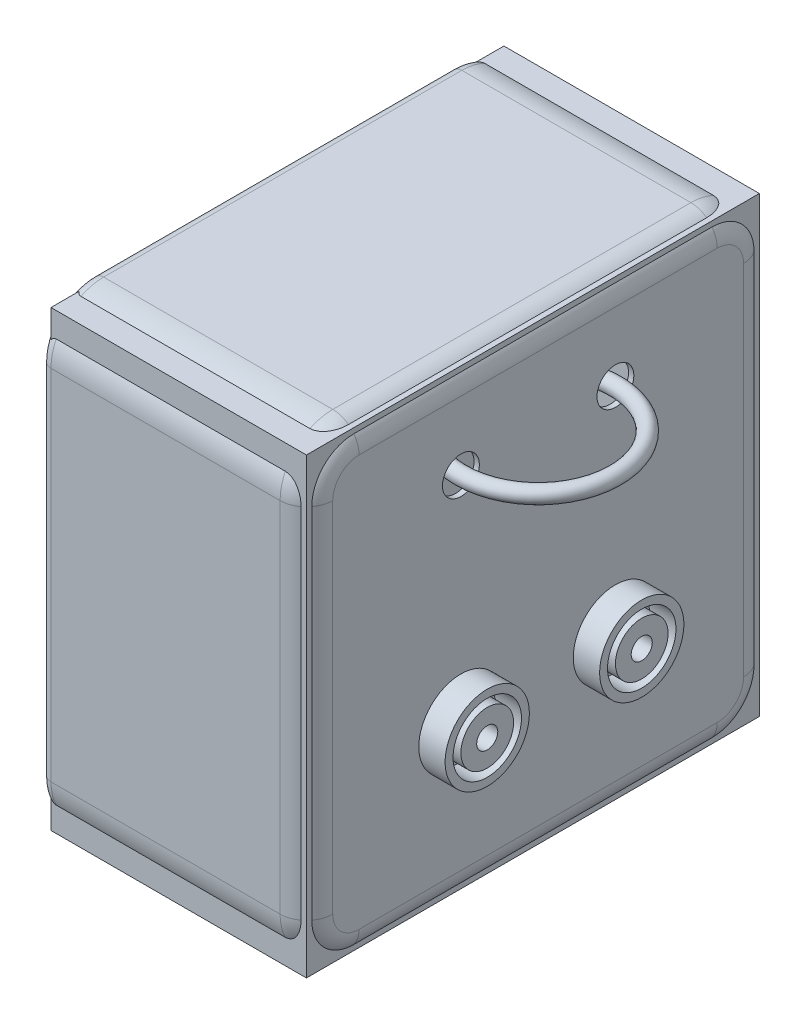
ISO-10303-21;
HEADER;
FILE_DESCRIPTION(('STEP AP214'),'2;1');
FILE_NAME('part.step','',(''),(''),'','','');
FILE_SCHEMA(('AUTOMOTIVE_DESIGN { 1 0 10303 214 1 1 1 1 }'));
ENDSEC;
DATA;
#1=APPLICATION_CONTEXT('core data for automotive mechanical design processes');
#2=APPLICATION_PROTOCOL_DEFINITION('international standard','automotive_design',2000,#1);
#3=PRODUCT_CONTEXT('',#1,'mechanical');
#4=PRODUCT('Part','Part','',(#3));
#5=PRODUCT_RELATED_PRODUCT_CATEGORY('part','',(#4));
#6=PRODUCT_DEFINITION_FORMATION('','',#4);
#7=PRODUCT_DEFINITION_CONTEXT('part definition',#1,'design');
#8=PRODUCT_DEFINITION('design','',#6,#7);
#9=PRODUCT_DEFINITION_SHAPE('','',#8);
#10=(LENGTH_UNIT() NAMED_UNIT(*) SI_UNIT(.MILLI.,.METRE.));
#11=(NAMED_UNIT(*) PLANE_ANGLE_UNIT() SI_UNIT($,.RADIAN.));
#12=(NAMED_UNIT(*) SI_UNIT($,.STERADIAN.) SOLID_ANGLE_UNIT());
#13=UNCERTAINTY_MEASURE_WITH_UNIT(LENGTH_MEASURE(1.E-05),#10,'distance_accuracy_value','');
#14=(GEOMETRIC_REPRESENTATION_CONTEXT(3) GLOBAL_UNCERTAINTY_ASSIGNED_CONTEXT((#13)) GLOBAL_UNIT_ASSIGNED_CONTEXT((#10,
#11,#12)) REPRESENTATION_CONTEXT('',''));
#15=CARTESIAN_POINT('',(0.,0.,0.));
#16=DIRECTION('',(0.,0.,1.));
#17=DIRECTION('',(1.,0.,0.));
#18=AXIS2_PLACEMENT_3D('',#15,#16,#17);
#19=CARTESIAN_POINT('',(25.25,26.,0.));
#20=DIRECTION('',(0.,1.,0.));
#21=DIRECTION('',(0.,0.,1.));
#22=AXIS2_PLACEMENT_3D('',#19,#20,#21);
#23=TOROIDAL_SURFACE('',#22,14.6666666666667,1.5);
#24=CARTESIAN_POINT('',(25.25,26.,14.6666666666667));
#25=DIRECTION('',(1.,0.,0.));
#26=DIRECTION('',(0.,0.,-1.));
#27=AXIS2_PLACEMENT_3D('',#24,#25,#26);
#28=CIRCLE('',#27,1.5);
#29=CARTESIAN_POINT('',(25.25,26.,16.1666666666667));
#30=VERTEX_POINT('',#29);
#31=EDGE_CURVE('E11',#30,#30,#28,.T.);
#32=CARTESIAN_POINT('',(25.25,26.,0.));
#33=DIRECTION('',(0.,1.,0.));
#34=DIRECTION('',(0.,0.,1.));
#35=AXIS2_PLACEMENT_3D('',#32,#33,#34);
#36=CIRCLE('',#35,16.1666666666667);
#37=EDGE_CURVE('',#30,#30,#36,.T.);
#38=ORIENTED_EDGE('',*,*,#31,.T.);
#39=ORIENTED_EDGE('',*,*,#31,.F.);
#40=ORIENTED_EDGE('',*,*,#37,.T.);
#41=ORIENTED_EDGE('',*,*,#37,.F.);
#42=EDGE_LOOP('',(#38,#40,#39,#41));
#43=FACE_BOUND('',#42,.T.);
#44=ADVANCED_FACE('F44',(#43),#23,.T.);
#45=CLOSED_SHELL('',(#44));
#46=MANIFOLD_SOLID_BREP('B2',#45);
#47=CARTESIAN_POINT('',(-24.25,43.,-43.));
#48=DIRECTION('',(0.,0.,-1.));
#49=DIRECTION('',(-1.,0.,0.));
#50=AXIS2_PLACEMENT_3D('',#47,#48,#49);
#51=PLANE('',#50);
#52=DIRECTION('',(0.,1.,0.));
#53=VECTOR('',#52,1.);
#54=CARTESIAN_POINT('',(24.25,43.,-43.));
#55=LINE('',#54,#53);
#56=CARTESIAN_POINT('',(24.25,-43.,-43.));
#57=VERTEX_POINT('',#56);
#58=CARTESIAN_POINT('',(24.25,43.,-43.));
#59=VERTEX_POINT('',#58);
#60=EDGE_CURVE('E206',#57,#59,#55,.T.);
#61=ORIENTED_EDGE('',*,*,#60,.T.);
#62=DIRECTION('',(1.,0.,0.));
#63=VECTOR('',#62,1.);
#64=CARTESIAN_POINT('',(-24.25,43.,-43.));
#65=LINE('',#64,#63);
#66=CARTESIAN_POINT('',(-24.25,43.,-43.));
#67=VERTEX_POINT('',#66);
#68=EDGE_CURVE('E200',#67,#59,#65,.T.);
#69=ORIENTED_EDGE('',*,*,#68,.F.);
#70=DIRECTION('',(0.,1.,0.));
#71=VECTOR('',#70,1.);
#72=CARTESIAN_POINT('',(-24.25,43.,-43.));
#73=LINE('',#72,#71);
#74=CARTESIAN_POINT('',(-24.25,-43.,-43.));
#75=VERTEX_POINT('',#74);
#76=EDGE_CURVE('E203',#75,#67,#73,.T.);
#77=ORIENTED_EDGE('',*,*,#76,.F.);
#78=DIRECTION('',(1.,0.,0.));
#79=VECTOR('',#78,1.);
#80=CARTESIAN_POINT('',(-24.25,-43.,-43.));
#81=LINE('',#80,#79);
#82=EDGE_CURVE('E240',#75,#57,#81,.T.);
#83=ORIENTED_EDGE('',*,*,#82,.T.);
#84=EDGE_LOOP('',(#61,#69,#77,#83));
#85=FACE_BOUND('',#84,.T.);
#86=ADVANCED_FACE('F62',(#85),#51,.F.);
#87=CARTESIAN_POINT('',(-24.25,-43.,43.));
#88=DIRECTION('',(0.,-1.,0.));
#89=DIRECTION('',(0.,0.,-1.));
#90=AXIS2_PLACEMENT_3D('',#87,#88,#89);
#91=PLANE('',#90);
#92=DIRECTION('',(0.,0.,-1.));
#93=VECTOR('',#92,1.);
#94=CARTESIAN_POINT('',(24.25,-43.,43.));
#95=LINE('',#94,#93);
#96=CARTESIAN_POINT('',(24.25,-43.,43.));
#97=VERTEX_POINT('',#96);
#98=EDGE_CURVE('E223',#97,#57,#95,.T.);
#99=ORIENTED_EDGE('',*,*,#98,.T.);
#100=ORIENTED_EDGE('',*,*,#82,.F.);
#101=DIRECTION('',(0.,0.,-1.));
#102=VECTOR('',#101,1.);
#103=CARTESIAN_POINT('',(-24.25,-43.,43.));
#104=LINE('',#103,#102);
#105=CARTESIAN_POINT('',(-24.25,-43.,43.));
#106=VERTEX_POINT('',#105);
#107=EDGE_CURVE('E211',#106,#75,#104,.T.);
#108=ORIENTED_EDGE('',*,*,#107,.F.);
#109=DIRECTION('',(1.,0.,0.));
#110=VECTOR('',#109,1.);
#111=CARTESIAN_POINT('',(-24.25,-43.,43.));
#112=LINE('',#111,#110);
#113=EDGE_CURVE('E243',#106,#97,#112,.T.);
#114=ORIENTED_EDGE('',*,*,#113,.T.);
#115=EDGE_LOOP('',(#99,#100,#108,#114));
#116=FACE_BOUND('',#115,.T.);
#117=ADVANCED_FACE('F484',(#116),#91,.F.);
#118=CARTESIAN_POINT('',(-24.25,43.,43.));
#119=DIRECTION('',(0.,0.,1.));
#120=DIRECTION('',(1.,0.,0.));
#121=AXIS2_PLACEMENT_3D('',#118,#119,#120);
#122=PLANE('',#121);
#123=DIRECTION('',(0.,-1.,0.));
#124=VECTOR('',#123,1.);
#125=CARTESIAN_POINT('',(24.25,43.,43.));
#126=LINE('',#125,#124);
#127=CARTESIAN_POINT('',(24.25,43.,43.));
#128=VERTEX_POINT('',#127);
#129=EDGE_CURVE('E226',#128,#97,#126,.T.);
#130=ORIENTED_EDGE('',*,*,#129,.T.);
#131=ORIENTED_EDGE('',*,*,#113,.F.);
#132=DIRECTION('',(0.,-1.,0.));
#133=VECTOR('',#132,1.);
#134=CARTESIAN_POINT('',(-24.25,43.,43.));
#135=LINE('',#134,#133);
#136=CARTESIAN_POINT('',(-24.25,43.,43.));
#137=VERTEX_POINT('',#136);
#138=EDGE_CURVE('E219',#137,#106,#135,.T.);
#139=ORIENTED_EDGE('',*,*,#138,.F.);
#140=DIRECTION('',(1.,0.,0.));
#141=VECTOR('',#140,1.);
#142=CARTESIAN_POINT('',(-24.25,43.,43.));
#143=LINE('',#142,#141);
#144=EDGE_CURVE('E210',#137,#128,#143,.T.);
#145=ORIENTED_EDGE('',*,*,#144,.T.);
#146=EDGE_LOOP('',(#130,#131,#139,#145));
#147=FACE_BOUND('',#146,.T.);
#148=ADVANCED_FACE('F490',(#147),#122,.F.);
#149=CARTESIAN_POINT('',(-24.25,43.,43.));
#150=DIRECTION('',(0.,1.,0.));
#151=DIRECTION('',(0.,0.,1.));
#152=AXIS2_PLACEMENT_3D('',#149,#150,#151);
#153=PLANE('',#152);
#154=DIRECTION('',(0.,0.,1.));
#155=VECTOR('',#154,1.);
#156=CARTESIAN_POINT('',(24.25,43.,43.));
#157=LINE('',#156,#155);
#158=EDGE_CURVE('E235',#59,#128,#157,.T.);
#159=ORIENTED_EDGE('',*,*,#158,.T.);
#160=ORIENTED_EDGE('',*,*,#144,.F.);
#161=DIRECTION('',(0.,0.,1.));
#162=VECTOR('',#161,1.);
#163=CARTESIAN_POINT('',(-24.25,43.,43.));
#164=LINE('',#163,#162);
#165=EDGE_CURVE('E214',#67,#137,#164,.T.);
#166=ORIENTED_EDGE('',*,*,#165,.F.);
#167=ORIENTED_EDGE('',*,*,#68,.T.);
#168=EDGE_LOOP('',(#159,#160,#166,#167));
#169=FACE_BOUND('',#168,.T.);
#170=ADVANCED_FACE('F215',(#169),#153,.F.);
#171=CARTESIAN_POINT('',(-24.25,0.,0.));
#172=DIRECTION('',(1.,0.,0.));
#173=DIRECTION('',(0.,0.,-1.));
#174=AXIS2_PLACEMENT_3D('',#171,#172,#173);
#175=PLANE('',#174);
#176=CARTESIAN_POINT('',(-24.25,-27.,-29.));
#177=DIRECTION('',(1.,0.,0.));
#178=DIRECTION('',(0.,0.,-1.));
#179=AXIS2_PLACEMENT_3D('',#176,#177,#178);
#180=CIRCLE('',#179,1.585);
#181=CARTESIAN_POINT('',(-24.25,-27.,-30.585));
#182=VERTEX_POINT('',#181);
#183=EDGE_CURVE('E987',#182,#182,#180,.F.);
#184=ORIENTED_EDGE('',*,*,#183,.T.);
#185=EDGE_LOOP('',(#184));
#186=FACE_BOUND('',#185,.T.);
#187=CARTESIAN_POINT('',(-24.25,-27.,29.));
#188=DIRECTION('',(1.,0.,0.));
#189=DIRECTION('',(0.,0.,-1.));
#190=AXIS2_PLACEMENT_3D('',#187,#188,#189);
#191=CIRCLE('',#190,1.585);
#192=CARTESIAN_POINT('',(-24.25,-27.,27.415));
#193=VERTEX_POINT('',#192);
#194=EDGE_CURVE('E991',#193,#193,#191,.F.);
#195=ORIENTED_EDGE('',*,*,#194,.T.);
#196=EDGE_LOOP('',(#195));
#197=FACE_BOUND('',#196,.T.);
#198=CARTESIAN_POINT('',(-24.25,27.,29.));
#199=DIRECTION('',(1.,0.,0.));
#200=DIRECTION('',(0.,0.,-1.));
#201=AXIS2_PLACEMENT_3D('',#198,#199,#200);
#202=CIRCLE('',#201,1.585);
#203=CARTESIAN_POINT('',(-24.25,27.,27.415));
#204=VERTEX_POINT('',#203);
#205=EDGE_CURVE('E1104',#204,#204,#202,.F.);
#206=ORIENTED_EDGE('',*,*,#205,.T.);
#207=EDGE_LOOP('',(#206));
#208=FACE_BOUND('',#207,.T.);
#209=CARTESIAN_POINT('',(-24.25,27.,-29.));
#210=DIRECTION('',(1.,0.,0.));
#211=DIRECTION('',(0.,0.,-1.));
#212=AXIS2_PLACEMENT_3D('',#209,#210,#211);
#213=CIRCLE('',#212,1.585);
#214=CARTESIAN_POINT('',(-24.25,27.,-30.585));
#215=VERTEX_POINT('',#214);
#216=EDGE_CURVE('E999',#215,#215,#213,.F.);
#217=ORIENTED_EDGE('',*,*,#216,.T.);
#218=EDGE_LOOP('',(#217));
#219=FACE_BOUND('',#218,.T.);
#220=ORIENTED_EDGE('',*,*,#76,.T.);
#221=ORIENTED_EDGE('',*,*,#165,.T.);
#222=ORIENTED_EDGE('',*,*,#138,.T.);
#223=ORIENTED_EDGE('',*,*,#107,.T.);
#224=EDGE_LOOP('',(#220,#221,#222,#223));
#225=FACE_BOUND('',#224,.T.);
#226=ADVANCED_FACE('F221',(#186,#197,#208,#219,#225),#175,.T.);
#227=CARTESIAN_POINT('',(24.25,0.,0.));
#228=DIRECTION('',(1.,0.,0.));
#229=DIRECTION('',(0.,0.,-1.));
#230=AXIS2_PLACEMENT_3D('',#227,#228,#229);
#231=PLANE('',#230);
#232=CARTESIAN_POINT('',(24.25,26.,-14.6666666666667));
#233=DIRECTION('',(1.,0.,0.));
#234=DIRECTION('',(0.,0.,-1.));
#235=AXIS2_PLACEMENT_3D('',#232,#233,#234);
#236=CIRCLE('',#235,3.5);
#237=CARTESIAN_POINT('',(24.25,26.,-18.1666666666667));
#238=VERTEX_POINT('',#237);
#239=EDGE_CURVE('E1025',#238,#238,#236,.T.);
#240=ORIENTED_EDGE('',*,*,#239,.T.);
#241=EDGE_LOOP('',(#240));
#242=FACE_BOUND('',#241,.T.);
#243=CARTESIAN_POINT('',(24.25,26.,14.6666666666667));
#244=DIRECTION('',(1.,0.,0.));
#245=DIRECTION('',(0.,0.,-1.));
#246=AXIS2_PLACEMENT_3D('',#243,#244,#245);
#247=CIRCLE('',#246,3.5);
#248=CARTESIAN_POINT('',(24.25,26.,11.1666666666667));
#249=VERTEX_POINT('',#248);
#250=EDGE_CURVE('E1054',#249,#249,#247,.F.);
#251=ORIENTED_EDGE('',*,*,#250,.F.);
#252=EDGE_LOOP('',(#251));
#253=FACE_BOUND('',#252,.T.);
#254=ORIENTED_EDGE('',*,*,#60,.F.);
#255=ORIENTED_EDGE('',*,*,#98,.F.);
#256=ORIENTED_EDGE('',*,*,#129,.F.);
#257=ORIENTED_EDGE('',*,*,#158,.F.);
#258=EDGE_LOOP('',(#254,#255,#256,#257));
#259=FACE_BOUND('',#258,.T.);
#260=ADVANCED_FACE('F580',(#242,#253,#259),#231,.F.);
#261=CARTESIAN_POINT('',(-25.251,26.,14.6666666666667));
#262=DIRECTION('',(1.,0.,0.));
#263=DIRECTION('',(0.,0.,-1.));
#264=AXIS2_PLACEMENT_3D('',#261,#262,#263);
#265=CYLINDRICAL_SURFACE('',#264,3.5);
#266=CARTESIAN_POINT('',(25.25,26.,14.6666666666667));
#267=DIRECTION('',(1.,0.,0.));
#268=DIRECTION('',(0.,0.,-1.));
#269=AXIS2_PLACEMENT_3D('',#266,#267,#268);
#270=CIRCLE('',#269,3.5);
#271=CARTESIAN_POINT('',(25.25,26.,11.1666666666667));
#272=VERTEX_POINT('',#271);
#273=EDGE_CURVE('E1043',#272,#272,#270,.T.);
#274=CARTESIAN_POINT('',(25.25,26.,11.1666666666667));
#275=CARTESIAN_POINT('',(25.2395833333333,26.,11.1666666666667));
#276=CARTESIAN_POINT('',(25.2291666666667,26.,11.1666666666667));
#277=CARTESIAN_POINT('',(25.2083333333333,26.,11.1666666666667));
#278=CARTESIAN_POINT('',(25.1979166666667,26.,11.1666666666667));
#279=CARTESIAN_POINT('',(25.1770833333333,26.,11.1666666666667));
#280=CARTESIAN_POINT('',(25.1666666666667,26.,11.1666666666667));
#281=CARTESIAN_POINT('',(25.1458333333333,26.,11.1666666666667));
#282=CARTESIAN_POINT('',(25.1354166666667,26.,11.1666666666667));
#283=CARTESIAN_POINT('',(25.1145833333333,26.,11.1666666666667));
#284=CARTESIAN_POINT('',(25.1041666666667,26.,11.1666666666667));
#285=CARTESIAN_POINT('',(25.0833333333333,26.,11.1666666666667));
#286=CARTESIAN_POINT('',(25.0729166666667,26.,11.1666666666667));
#287=CARTESIAN_POINT('',(25.0520833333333,26.,11.1666666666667));
#288=CARTESIAN_POINT('',(25.0416666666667,26.,11.1666666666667));
#289=CARTESIAN_POINT('',(25.0208333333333,26.,11.1666666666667));
#290=CARTESIAN_POINT('',(25.0104166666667,26.,11.1666666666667));
#291=CARTESIAN_POINT('',(24.9895833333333,26.,11.1666666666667));
#292=CARTESIAN_POINT('',(24.9791666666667,26.,11.1666666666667));
#293=CARTESIAN_POINT('',(24.9583333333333,26.,11.1666666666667));
#294=CARTESIAN_POINT('',(24.9479166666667,26.,11.1666666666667));
#295=CARTESIAN_POINT('',(24.9270833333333,26.,11.1666666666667));
#296=CARTESIAN_POINT('',(24.9166666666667,26.,11.1666666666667));
#297=CARTESIAN_POINT('',(24.8958333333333,26.,11.1666666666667));
#298=CARTESIAN_POINT('',(24.8854166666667,26.,11.1666666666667));
#299=CARTESIAN_POINT('',(24.8645833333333,26.,11.1666666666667));
#300=CARTESIAN_POINT('',(24.8541666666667,26.,11.1666666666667));
#301=CARTESIAN_POINT('',(24.8333333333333,26.,11.1666666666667));
#302=CARTESIAN_POINT('',(24.8229166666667,26.,11.1666666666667));
#303=CARTESIAN_POINT('',(24.8020833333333,26.,11.1666666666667));
#304=CARTESIAN_POINT('',(24.7916666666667,26.,11.1666666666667));
#305=CARTESIAN_POINT('',(24.7708333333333,26.,11.1666666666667));
#306=CARTESIAN_POINT('',(24.7604166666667,26.,11.1666666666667));
#307=CARTESIAN_POINT('',(24.7395833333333,26.,11.1666666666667));
#308=CARTESIAN_POINT('',(24.7291666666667,26.,11.1666666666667));
#309=CARTESIAN_POINT('',(24.7083333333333,26.,11.1666666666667));
#310=CARTESIAN_POINT('',(24.6979166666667,26.,11.1666666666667));
#311=CARTESIAN_POINT('',(24.6770833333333,26.,11.1666666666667));
#312=CARTESIAN_POINT('',(24.6666666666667,26.,11.1666666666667));
#313=CARTESIAN_POINT('',(24.6458333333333,26.,11.1666666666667));
#314=CARTESIAN_POINT('',(24.6354166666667,26.,11.1666666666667));
#315=CARTESIAN_POINT('',(24.6145833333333,26.,11.1666666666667));
#316=CARTESIAN_POINT('',(24.6041666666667,26.,11.1666666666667));
#317=CARTESIAN_POINT('',(24.5833333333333,26.,11.1666666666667));
#318=CARTESIAN_POINT('',(24.5729166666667,26.,11.1666666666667));
#319=CARTESIAN_POINT('',(24.5520833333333,26.,11.1666666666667));
#320=CARTESIAN_POINT('',(24.5416666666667,26.,11.1666666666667));
#321=CARTESIAN_POINT('',(24.5208333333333,26.,11.1666666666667));
#322=CARTESIAN_POINT('',(24.5104166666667,26.,11.1666666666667));
#323=CARTESIAN_POINT('',(24.4895833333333,26.,11.1666666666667));
#324=CARTESIAN_POINT('',(24.4791666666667,26.,11.1666666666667));
#325=CARTESIAN_POINT('',(24.4583333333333,26.,11.1666666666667));
#326=CARTESIAN_POINT('',(24.4479166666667,26.,11.1666666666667));
#327=CARTESIAN_POINT('',(24.4270833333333,26.,11.1666666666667));
#328=CARTESIAN_POINT('',(24.4166666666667,26.,11.1666666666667));
#329=CARTESIAN_POINT('',(24.3958333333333,26.,11.1666666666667));
#330=CARTESIAN_POINT('',(24.3854166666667,26.,11.1666666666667));
#331=CARTESIAN_POINT('',(24.3645833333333,26.,11.1666666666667));
#332=CARTESIAN_POINT('',(24.3541666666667,26.,11.1666666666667));
#333=CARTESIAN_POINT('',(24.3333333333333,26.,11.1666666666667));
#334=CARTESIAN_POINT('',(24.3229166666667,26.,11.1666666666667));
#335=CARTESIAN_POINT('',(24.3020833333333,26.,11.1666666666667));
#336=CARTESIAN_POINT('',(24.2916666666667,26.,11.1666666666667));
#337=CARTESIAN_POINT('',(24.2708333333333,26.,11.1666666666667));
#338=CARTESIAN_POINT('',(24.2604166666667,26.,11.1666666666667));
#339=CARTESIAN_POINT('',(24.25,26.,11.1666666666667));
#340=B_SPLINE_CURVE_WITH_KNOTS('',3,(#274,#275,#276,#277,#278,#279,#280,#281,#282,#283,#284,
#285,#286,#287,#288,#289,#290,#291,#292,#293,#294,#295,#296,#297,#298,#299,#300,#301,#302,#303,
#304,#305,#306,#307,#308,#309,#310,#311,#312,#313,#314,#315,#316,#317,#318,#319,#320,#321,#322,
#323,#324,#325,#326,#327,#328,#329,#330,#331,#332,#333,#334,#335,#336,#337,#338,#339),
.UNSPECIFIED.,.F.,.F.,(4,2,2,2,2,2,2,2,2,2,2,2,2,2,2,2,2,2,2,2,2,2,2,2,2,2,2,2,2,2,2,2,4),(0.,
0.0312499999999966,0.0625000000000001,0.0937500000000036,0.125,0.156249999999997,0.1875,
0.218750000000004,0.25,0.281249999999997,0.3125,0.343750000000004,0.375,0.406249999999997,
0.4375,0.468750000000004,0.5,0.531249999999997,0.5625,0.593750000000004,0.625000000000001,
0.656249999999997,0.687500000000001,0.718750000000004,0.750000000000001,0.781249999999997,
0.812500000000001,0.843750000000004,0.875000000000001,0.906249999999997,0.937500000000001,
0.968750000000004,1.),.UNSPECIFIED.);
#341=EDGE_CURVE('BSEAM510',#272,#249,#340,.T.);
#342=ORIENTED_EDGE('',*,*,#273,.T.);
#343=ORIENTED_EDGE('',*,*,#250,.T.);
#344=ORIENTED_EDGE('',*,*,#341,.T.);
#345=ORIENTED_EDGE('',*,*,#341,.F.);
#346=EDGE_LOOP('',(#342,#344,#343,#345));
#347=FACE_BOUND('',#346,.T.);
#348=ADVANCED_FACE('F510',(#347),#265,.F.);
#349=CARTESIAN_POINT('',(25.25,44.,-44.));
#350=DIRECTION('',(0.,0.,1.));
#351=DIRECTION('',(0.,-1.,0.));
#352=AXIS2_PLACEMENT_3D('',#349,#350,#351);
#353=PLANE('',#352);
#354=DIRECTION('',(-1.,0.,0.));
#355=VECTOR('',#354,1.);
#356=CARTESIAN_POINT('',(25.25,-34.,-44.));
#357=LINE('',#356,#355);
#358=CARTESIAN_POINT('',(20.25,-34.,-44.));
#359=VERTEX_POINT('',#358);
#360=CARTESIAN_POINT('',(-23.25,-34.,-44.));
#361=VERTEX_POINT('',#360);
#362=EDGE_CURVE('E258',#359,#361,#357,.T.);
#363=ORIENTED_EDGE('',*,*,#362,.T.);
#364=DIRECTION('',(0.,1.,0.));
#365=VECTOR('',#364,1.);
#366=CARTESIAN_POINT('',(-23.25,44.,-44.));
#367=LINE('',#366,#365);
#368=CARTESIAN_POINT('',(-23.25,34.,-44.));
#369=VERTEX_POINT('',#368);
#370=EDGE_CURVE('E347',#361,#369,#367,.T.);
#371=ORIENTED_EDGE('',*,*,#370,.T.);
#372=DIRECTION('',(-1.,0.,0.));
#373=VECTOR('',#372,1.);
#374=CARTESIAN_POINT('',(25.25,34.,-44.));
#375=LINE('',#374,#373);
#376=CARTESIAN_POINT('',(20.25,34.,-44.));
#377=VERTEX_POINT('',#376);
#378=EDGE_CURVE('E261',#369,#377,#375,.F.);
#379=ORIENTED_EDGE('',*,*,#378,.T.);
#380=DIRECTION('',(0.,1.,0.));
#381=VECTOR('',#380,1.);
#382=CARTESIAN_POINT('',(20.25,-34.,-44.));
#383=LINE('',#382,#381);
#384=EDGE_CURVE('E288',#377,#359,#383,.F.);
#385=ORIENTED_EDGE('',*,*,#384,.T.);
#386=EDGE_LOOP('',(#363,#371,#379,#385));
#387=FACE_BOUND('',#386,.T.);
#388=ADVANCED_FACE('F392',(#387),#353,.F.);
#389=CARTESIAN_POINT('',(25.25,44.,44.));
#390=DIRECTION('',(0.,-1.,0.));
#391=DIRECTION('',(0.,0.,-1.));
#392=AXIS2_PLACEMENT_3D('',#389,#390,#391);
#393=PLANE('',#392);
#394=DIRECTION('',(-1.,0.,0.));
#395=VECTOR('',#394,1.);
#396=CARTESIAN_POINT('',(25.25,44.,-34.));
#397=LINE('',#396,#395);
#398=CARTESIAN_POINT('',(20.25,44.,-34.));
#399=VERTEX_POINT('',#398);
#400=CARTESIAN_POINT('',(-23.25,44.,-34.));
#401=VERTEX_POINT('',#400);
#402=EDGE_CURVE('E249',#399,#401,#397,.T.);
#403=ORIENTED_EDGE('',*,*,#402,.T.);
#404=DIRECTION('',(0.,0.,1.));
#405=VECTOR('',#404,1.);
#406=CARTESIAN_POINT('',(-23.25,44.,44.));
#407=LINE('',#406,#405);
#408=CARTESIAN_POINT('',(-23.25,44.,34.));
#409=VERTEX_POINT('',#408);
#410=EDGE_CURVE('E343',#401,#409,#407,.T.);
#411=ORIENTED_EDGE('',*,*,#410,.T.);
#412=DIRECTION('',(-1.,0.,0.));
#413=VECTOR('',#412,1.);
#414=CARTESIAN_POINT('',(25.25,44.,34.));
#415=LINE('',#414,#413);
#416=CARTESIAN_POINT('',(20.25,44.,34.));
#417=VERTEX_POINT('',#416);
#418=EDGE_CURVE('E252',#409,#417,#415,.F.);
#419=ORIENTED_EDGE('',*,*,#418,.T.);
#420=DIRECTION('',(0.,0.,1.));
#421=VECTOR('',#420,1.);
#422=CARTESIAN_POINT('',(20.25,44.,-34.));
#423=LINE('',#422,#421);
#424=EDGE_CURVE('E283',#417,#399,#423,.F.);
#425=ORIENTED_EDGE('',*,*,#424,.T.);
#426=EDGE_LOOP('',(#403,#411,#419,#425));
#427=FACE_BOUND('',#426,.T.);
#428=ADVANCED_FACE('F446',(#427),#393,.F.);
#429=CARTESIAN_POINT('',(25.25,44.,44.));
#430=DIRECTION('',(0.,0.,-1.));
#431=DIRECTION('',(0.,1.,0.));
#432=AXIS2_PLACEMENT_3D('',#429,#430,#431);
#433=PLANE('',#432);
#434=DIRECTION('',(-1.,0.,0.));
#435=VECTOR('',#434,1.);
#436=CARTESIAN_POINT('',(25.25,34.,44.));
#437=LINE('',#436,#435);
#438=CARTESIAN_POINT('',(20.25,34.,44.));
#439=VERTEX_POINT('',#438);
#440=CARTESIAN_POINT('',(-23.25,34.,44.));
#441=VERTEX_POINT('',#440);
#442=EDGE_CURVE('E247',#439,#441,#437,.T.);
#443=ORIENTED_EDGE('',*,*,#442,.T.);
#444=DIRECTION('',(0.,-1.,0.));
#445=VECTOR('',#444,1.);
#446=CARTESIAN_POINT('',(-23.25,44.,44.));
#447=LINE('',#446,#445);
#448=CARTESIAN_POINT('',(-23.25,-34.,44.));
#449=VERTEX_POINT('',#448);
#450=EDGE_CURVE('E70',#441,#449,#447,.T.);
#451=ORIENTED_EDGE('',*,*,#450,.T.);
#452=DIRECTION('',(-1.,0.,0.));
#453=VECTOR('',#452,1.);
#454=CARTESIAN_POINT('',(25.25,-34.,44.));
#455=LINE('',#454,#453);
#456=CARTESIAN_POINT('',(20.25,-34.,44.));
#457=VERTEX_POINT('',#456);
#458=EDGE_CURVE('E242',#449,#457,#455,.F.);
#459=ORIENTED_EDGE('',*,*,#458,.T.);
#460=DIRECTION('',(0.,-1.,0.));
#461=VECTOR('',#460,1.);
#462=CARTESIAN_POINT('',(20.25,34.,44.));
#463=LINE('',#462,#461);
#464=EDGE_CURVE('E298',#457,#439,#463,.F.);
#465=ORIENTED_EDGE('',*,*,#464,.T.);
#466=EDGE_LOOP('',(#443,#451,#459,#465));
#467=FACE_BOUND('',#466,.T.);
#468=ADVANCED_FACE('F432',(#467),#433,.F.);
#469=CARTESIAN_POINT('',(25.25,-44.,44.));
#470=DIRECTION('',(0.,1.,0.));
#471=DIRECTION('',(0.,0.,1.));
#472=AXIS2_PLACEMENT_3D('',#469,#470,#471);
#473=PLANE('',#472);
#474=DIRECTION('',(-1.,0.,0.));
#475=VECTOR('',#474,1.);
#476=CARTESIAN_POINT('',(25.25,-44.,34.));
#477=LINE('',#476,#475);
#478=CARTESIAN_POINT('',(20.25,-44.,34.));
#479=VERTEX_POINT('',#478);
#480=CARTESIAN_POINT('',(-23.25,-44.,34.));
#481=VERTEX_POINT('',#480);
#482=EDGE_CURVE('E256',#479,#481,#477,.T.);
#483=ORIENTED_EDGE('',*,*,#482,.T.);
#484=DIRECTION('',(0.,0.,-1.));
#485=VECTOR('',#484,1.);
#486=CARTESIAN_POINT('',(-23.25,-44.,44.));
#487=LINE('',#486,#485);
#488=CARTESIAN_POINT('',(-23.25,-44.,-34.));
#489=VERTEX_POINT('',#488);
#490=EDGE_CURVE('E351',#481,#489,#487,.T.);
#491=ORIENTED_EDGE('',*,*,#490,.T.);
#492=DIRECTION('',(-1.,0.,0.));
#493=VECTOR('',#492,1.);
#494=CARTESIAN_POINT('',(25.25,-44.,-34.));
#495=LINE('',#494,#493);
#496=CARTESIAN_POINT('',(20.25,-44.,-34.));
#497=VERTEX_POINT('',#496);
#498=EDGE_CURVE('E254',#489,#497,#495,.F.);
#499=ORIENTED_EDGE('',*,*,#498,.T.);
#500=DIRECTION('',(0.,0.,-1.));
#501=VECTOR('',#500,1.);
#502=CARTESIAN_POINT('',(20.25,-44.,34.));
#503=LINE('',#502,#501);
#504=EDGE_CURVE('E293',#497,#479,#503,.F.);
#505=ORIENTED_EDGE('',*,*,#504,.T.);
#506=EDGE_LOOP('',(#483,#491,#499,#505));
#507=FACE_BOUND('',#506,.T.);
#508=ADVANCED_FACE('F420',(#507),#473,.F.);
#509=CARTESIAN_POINT('',(25.25,0.,0.));
#510=DIRECTION('',(1.,0.,0.));
#511=DIRECTION('',(0.,0.,-1.));
#512=AXIS2_PLACEMENT_3D('',#509,#510,#511);
#513=PLANE('',#512);
#514=CARTESIAN_POINT('',(25.25,26.,-14.6666666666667));
#515=DIRECTION('',(-1.,0.,0.));
#516=DIRECTION('',(0.,0.,1.));
#517=AXIS2_PLACEMENT_3D('',#514,#515,#516);
#518=CIRCLE('',#517,3.5);
#519=CARTESIAN_POINT('',(25.25,26.,-18.1666666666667));
#520=VERTEX_POINT('',#519);
#521=EDGE_CURVE('E1024',#520,#520,#518,.T.);
#522=ORIENTED_EDGE('',*,*,#521,.T.);
#523=EDGE_LOOP('',(#522));
#524=FACE_BOUND('',#523,.T.);
#525=CARTESIAN_POINT('',(25.25,-14.6666666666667,-14.6666666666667));
#526=DIRECTION('',(1.,0.,0.));
#527=DIRECTION('',(0.,0.,-1.));
#528=AXIS2_PLACEMENT_3D('',#525,#526,#527);
#529=CIRCLE('',#528,8.);
#530=CARTESIAN_POINT('',(25.25,-14.6666666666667,-22.6666666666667));
#531=VERTEX_POINT('',#530);
#532=EDGE_CURVE('E42',#531,#531,#529,.T.);
#533=ORIENTED_EDGE('',*,*,#532,.F.);
#534=EDGE_LOOP('',(#533));
#535=FACE_BOUND('',#534,.T.);
#536=ORIENTED_EDGE('',*,*,#273,.F.);
#537=EDGE_LOOP('',(#536));
#538=FACE_BOUND('',#537,.T.);
#539=CARTESIAN_POINT('',(25.25,-14.6666666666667,14.6666666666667));
#540=DIRECTION('',(1.,0.,0.));
#541=DIRECTION('',(0.,0.,-1.));
#542=AXIS2_PLACEMENT_3D('',#539,#540,#541);
#543=CIRCLE('',#542,8.);
#544=CARTESIAN_POINT('',(25.25,-14.6666666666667,6.66666666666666));
#545=VERTEX_POINT('',#544);
#546=EDGE_CURVE('E229',#545,#545,#543,.T.);
#547=ORIENTED_EDGE('',*,*,#546,.F.);
#548=EDGE_LOOP('',(#547));
#549=FACE_BOUND('',#548,.T.);
#550=DIRECTION('',(0.,0.,1.));
#551=VECTOR('',#550,1.);
#552=CARTESIAN_POINT('',(25.25,39.,34.));
#553=LINE('',#552,#551);
#554=CARTESIAN_POINT('',(25.25,39.,-34.));
#555=VERTEX_POINT('',#554);
#556=CARTESIAN_POINT('',(25.25,39.,34.));
#557=VERTEX_POINT('',#556);
#558=EDGE_CURVE('E275',#555,#557,#553,.T.);
#559=ORIENTED_EDGE('',*,*,#558,.T.);
#560=CARTESIAN_POINT('',(25.25,34.,34.));
#561=DIRECTION('',(1.,0.,0.));
#562=DIRECTION('',(0.,0.,-1.));
#563=AXIS2_PLACEMENT_3D('',#560,#561,#562);
#564=CIRCLE('',#563,5.);
#565=CARTESIAN_POINT('',(25.25,34.,39.));
#566=VERTEX_POINT('',#565);
#567=EDGE_CURVE('E277',#557,#566,#564,.T.);
#568=ORIENTED_EDGE('',*,*,#567,.T.);
#569=DIRECTION('',(0.,-1.,0.));
#570=VECTOR('',#569,1.);
#571=CARTESIAN_POINT('',(25.25,-34.,39.));
#572=LINE('',#571,#570);
#573=CARTESIAN_POINT('',(25.25,-34.,39.));
#574=VERTEX_POINT('',#573);
#575=EDGE_CURVE('E263',#566,#574,#572,.T.);
#576=ORIENTED_EDGE('',*,*,#575,.T.);
#577=CARTESIAN_POINT('',(25.25,-34.,34.));
#578=DIRECTION('',(1.,0.,0.));
#579=DIRECTION('',(0.,0.,-1.));
#580=AXIS2_PLACEMENT_3D('',#577,#578,#579);
#581=CIRCLE('',#580,5.);
#582=CARTESIAN_POINT('',(25.25,-39.,34.));
#583=VERTEX_POINT('',#582);
#584=EDGE_CURVE('E265',#574,#583,#581,.T.);
#585=ORIENTED_EDGE('',*,*,#584,.T.);
#586=DIRECTION('',(0.,0.,-1.));
#587=VECTOR('',#586,1.);
#588=CARTESIAN_POINT('',(25.25,-39.,-34.));
#589=LINE('',#588,#587);
#590=CARTESIAN_POINT('',(25.25,-39.,-34.));
#591=VERTEX_POINT('',#590);
#592=EDGE_CURVE('E267',#583,#591,#589,.T.);
#593=ORIENTED_EDGE('',*,*,#592,.T.);
#594=CARTESIAN_POINT('',(25.25,-34.,-34.));
#595=DIRECTION('',(1.,0.,0.));
#596=DIRECTION('',(0.,0.,-1.));
#597=AXIS2_PLACEMENT_3D('',#594,#595,#596);
#598=CIRCLE('',#597,5.);
#599=CARTESIAN_POINT('',(25.25,-34.,-39.));
#600=VERTEX_POINT('',#599);
#601=EDGE_CURVE('E269',#591,#600,#598,.T.);
#602=ORIENTED_EDGE('',*,*,#601,.T.);
#603=DIRECTION('',(0.,1.,0.));
#604=VECTOR('',#603,1.);
#605=CARTESIAN_POINT('',(25.25,34.,-39.));
#606=LINE('',#605,#604);
#607=CARTESIAN_POINT('',(25.25,34.,-39.));
#608=VERTEX_POINT('',#607);
#609=EDGE_CURVE('E271',#600,#608,#606,.T.);
#610=ORIENTED_EDGE('',*,*,#609,.T.);
#611=CARTESIAN_POINT('',(25.25,34.,-34.));
#612=DIRECTION('',(1.,0.,0.));
#613=DIRECTION('',(0.,0.,-1.));
#614=AXIS2_PLACEMENT_3D('',#611,#612,#613);
#615=CIRCLE('',#614,5.);
#616=EDGE_CURVE('E273',#608,#555,#615,.T.);
#617=ORIENTED_EDGE('',*,*,#616,.T.);
#618=EDGE_LOOP('',(#559,#568,#576,#585,#593,#602,#610,#617));
#619=FACE_BOUND('',#618,.T.);
#620=ADVANCED_FACE('F407',(#524,#535,#538,#549,#619),#513,.T.);
#621=CARTESIAN_POINT('',(-25.25,0.,0.));
#622=DIRECTION('',(1.,0.,0.));
#623=DIRECTION('',(0.,0.,-1.));
#624=AXIS2_PLACEMENT_3D('',#621,#622,#623);
#625=PLANE('',#624);
#626=CARTESIAN_POINT('',(-25.25,-27.,-29.));
#627=DIRECTION('',(-1.,0.,0.));
#628=DIRECTION('',(0.,0.,1.));
#629=AXIS2_PLACEMENT_3D('',#626,#627,#628);
#630=CIRCLE('',#629,1.585);
#631=CARTESIAN_POINT('',(-25.25,-27.,-27.415));
#632=VERTEX_POINT('',#631);
#633=EDGE_CURVE('E990',#632,#632,#630,.T.);
#634=ORIENTED_EDGE('',*,*,#633,.F.);
#635=EDGE_LOOP('',(#634));
#636=FACE_BOUND('',#635,.T.);
#637=CARTESIAN_POINT('',(-25.25,-27.,29.));
#638=DIRECTION('',(-1.,0.,0.));
#639=DIRECTION('',(0.,0.,1.));
#640=AXIS2_PLACEMENT_3D('',#637,#638,#639);
#641=CIRCLE('',#640,1.585);
#642=CARTESIAN_POINT('',(-25.25,-27.,30.585));
#643=VERTEX_POINT('',#642);
#644=EDGE_CURVE('E994',#643,#643,#641,.T.);
#645=ORIENTED_EDGE('',*,*,#644,.F.);
#646=EDGE_LOOP('',(#645));
#647=FACE_BOUND('',#646,.T.);
#648=CARTESIAN_POINT('',(-25.25,27.,29.));
#649=DIRECTION('',(-1.,0.,0.));
#650=DIRECTION('',(0.,0.,1.));
#651=AXIS2_PLACEMENT_3D('',#648,#649,#650);
#652=CIRCLE('',#651,1.585);
#653=CARTESIAN_POINT('',(-25.25,27.,30.585));
#654=VERTEX_POINT('',#653);
#655=EDGE_CURVE('E1003',#654,#654,#652,.T.);
#656=ORIENTED_EDGE('',*,*,#655,.F.);
#657=EDGE_LOOP('',(#656));
#658=FACE_BOUND('',#657,.T.);
#659=CARTESIAN_POINT('',(-25.25,27.,-29.));
#660=DIRECTION('',(-1.,0.,0.));
#661=DIRECTION('',(0.,0.,1.));
#662=AXIS2_PLACEMENT_3D('',#659,#660,#661);
#663=CIRCLE('',#662,1.585);
#664=CARTESIAN_POINT('',(-25.25,27.,-27.415));
#665=VERTEX_POINT('',#664);
#666=EDGE_CURVE('E1002',#665,#665,#663,.T.);
#667=ORIENTED_EDGE('',*,*,#666,.F.);
#668=EDGE_LOOP('',(#667));
#669=FACE_BOUND('',#668,.T.);
#670=DIRECTION('',(0.,-1.,0.));
#671=VECTOR('',#670,1.);
#672=CARTESIAN_POINT('',(-25.25,0.,42.));
#673=LINE('',#672,#671);
#674=CARTESIAN_POINT('',(-25.25,-34.,42.));
#675=VERTEX_POINT('',#674);
#676=CARTESIAN_POINT('',(-25.25,34.,42.));
#677=VERTEX_POINT('',#676);
#678=EDGE_CURVE('E300',#675,#677,#673,.F.);
#679=ORIENTED_EDGE('',*,*,#678,.T.);
#680=CARTESIAN_POINT('',(-25.25,34.,34.));
#681=DIRECTION('',(1.,0.,0.));
#682=DIRECTION('',(0.,0.,-1.));
#683=AXIS2_PLACEMENT_3D('',#680,#681,#682);
#684=CIRCLE('',#683,8.);
#685=CARTESIAN_POINT('',(-25.25,42.,34.));
#686=VERTEX_POINT('',#685);
#687=EDGE_CURVE('E337',#677,#686,#684,.F.);
#688=ORIENTED_EDGE('',*,*,#687,.T.);
#689=DIRECTION('',(0.,0.,1.));
#690=VECTOR('',#689,1.);
#691=CARTESIAN_POINT('',(-25.25,42.,0.));
#692=LINE('',#691,#690);
#693=CARTESIAN_POINT('',(-25.25,42.,-34.));
#694=VERTEX_POINT('',#693);
#695=EDGE_CURVE('E335',#686,#694,#692,.F.);
#696=ORIENTED_EDGE('',*,*,#695,.T.);
#697=CARTESIAN_POINT('',(-25.25,34.,-34.));
#698=DIRECTION('',(1.,0.,0.));
#699=DIRECTION('',(0.,0.,-1.));
#700=AXIS2_PLACEMENT_3D('',#697,#698,#699);
#701=CIRCLE('',#700,8.);
#702=CARTESIAN_POINT('',(-25.25,34.,-42.));
#703=VERTEX_POINT('',#702);
#704=EDGE_CURVE('E333',#694,#703,#701,.F.);
#705=ORIENTED_EDGE('',*,*,#704,.T.);
#706=DIRECTION('',(0.,1.,0.));
#707=VECTOR('',#706,1.);
#708=CARTESIAN_POINT('',(-25.25,0.,-42.));
#709=LINE('',#708,#707);
#710=CARTESIAN_POINT('',(-25.25,-34.,-42.));
#711=VERTEX_POINT('',#710);
#712=EDGE_CURVE('E331',#703,#711,#709,.F.);
#713=ORIENTED_EDGE('',*,*,#712,.T.);
#714=CARTESIAN_POINT('',(-25.25,-34.,-34.));
#715=DIRECTION('',(1.,0.,0.));
#716=DIRECTION('',(0.,0.,-1.));
#717=AXIS2_PLACEMENT_3D('',#714,#715,#716);
#718=CIRCLE('',#717,8.);
#719=CARTESIAN_POINT('',(-25.25,-42.,-34.));
#720=VERTEX_POINT('',#719);
#721=EDGE_CURVE('E329',#711,#720,#718,.F.);
#722=ORIENTED_EDGE('',*,*,#721,.T.);
#723=DIRECTION('',(0.,0.,-1.));
#724=VECTOR('',#723,1.);
#725=CARTESIAN_POINT('',(-25.25,-42.,0.));
#726=LINE('',#725,#724);
#727=CARTESIAN_POINT('',(-25.25,-42.,34.));
#728=VERTEX_POINT('',#727);
#729=EDGE_CURVE('E327',#720,#728,#726,.F.);
#730=ORIENTED_EDGE('',*,*,#729,.T.);
#731=CARTESIAN_POINT('',(-25.25,-34.,34.));
#732=DIRECTION('',(1.,0.,0.));
#733=DIRECTION('',(0.,0.,-1.));
#734=AXIS2_PLACEMENT_3D('',#731,#732,#733);
#735=CIRCLE('',#734,8.);
#736=EDGE_CURVE('E325',#728,#675,#735,.F.);
#737=ORIENTED_EDGE('',*,*,#736,.T.);
#738=EDGE_LOOP('',(#679,#688,#696,#705,#713,#722,#730,#737));
#739=FACE_BOUND('',#738,.T.);
#740=ADVANCED_FACE('F472',(#636,#647,#658,#669,#739),#625,.F.);
#741=CARTESIAN_POINT('',(25.25,34.,34.));
#742=DIRECTION('',(-1.,0.,0.));
#743=DIRECTION('',(0.,0.,1.));
#744=AXIS2_PLACEMENT_3D('',#741,#742,#743);
#745=CYLINDRICAL_SURFACE('',#744,10.);
#746=ORIENTED_EDGE('',*,*,#418,.F.);
#747=CARTESIAN_POINT('',(-23.25,34.,34.));
#748=DIRECTION('',(1.,0.,0.));
#749=DIRECTION('',(0.,0.,-1.));
#750=AXIS2_PLACEMENT_3D('',#747,#748,#749);
#751=CIRCLE('',#750,10.);
#752=EDGE_CURVE('E340',#409,#441,#751,.T.);
#753=ORIENTED_EDGE('',*,*,#752,.T.);
#754=ORIENTED_EDGE('',*,*,#442,.F.);
#755=CARTESIAN_POINT('',(20.25,34.,34.));
#756=DIRECTION('',(1.,0.,0.));
#757=DIRECTION('',(0.,0.,-1.));
#758=AXIS2_PLACEMENT_3D('',#755,#756,#757);
#759=CIRCLE('',#758,10.);
#760=EDGE_CURVE('E280',#439,#417,#759,.F.);
#761=ORIENTED_EDGE('',*,*,#760,.T.);
#762=EDGE_LOOP('',(#746,#753,#754,#761));
#763=FACE_BOUND('',#762,.T.);
#764=ADVANCED_FACE('F436',(#763),#745,.T.);
#765=CARTESIAN_POINT('',(25.25,-34.,34.));
#766=DIRECTION('',(-1.,0.,0.));
#767=DIRECTION('',(0.,0.,1.));
#768=AXIS2_PLACEMENT_3D('',#765,#766,#767);
#769=CYLINDRICAL_SURFACE('',#768,10.);
#770=ORIENTED_EDGE('',*,*,#458,.F.);
#771=CARTESIAN_POINT('',(-23.25,-34.,34.));
#772=DIRECTION('',(1.,0.,0.));
#773=DIRECTION('',(0.,0.,-1.));
#774=AXIS2_PLACEMENT_3D('',#771,#772,#773);
#775=CIRCLE('',#774,10.);
#776=EDGE_CURVE('E83',#449,#481,#775,.T.);
#777=ORIENTED_EDGE('',*,*,#776,.T.);
#778=ORIENTED_EDGE('',*,*,#482,.F.);
#779=CARTESIAN_POINT('',(20.25,-34.,34.));
#780=DIRECTION('',(1.,0.,0.));
#781=DIRECTION('',(0.,0.,-1.));
#782=AXIS2_PLACEMENT_3D('',#779,#780,#781);
#783=CIRCLE('',#782,10.);
#784=EDGE_CURVE('E295',#479,#457,#783,.F.);
#785=ORIENTED_EDGE('',*,*,#784,.T.);
#786=EDGE_LOOP('',(#770,#777,#778,#785));
#787=FACE_BOUND('',#786,.T.);
#788=ADVANCED_FACE('F421',(#787),#769,.T.);
#789=CARTESIAN_POINT('',(25.25,34.,-34.));
#790=DIRECTION('',(-1.,0.,0.));
#791=DIRECTION('',(0.,0.,1.));
#792=AXIS2_PLACEMENT_3D('',#789,#790,#791);
#793=CYLINDRICAL_SURFACE('',#792,10.);
#794=ORIENTED_EDGE('',*,*,#378,.F.);
#795=CARTESIAN_POINT('',(-23.25,34.,-34.));
#796=DIRECTION('',(1.,0.,0.));
#797=DIRECTION('',(0.,0.,-1.));
#798=AXIS2_PLACEMENT_3D('',#795,#796,#797);
#799=CIRCLE('',#798,10.);
#800=EDGE_CURVE('E345',#369,#401,#799,.T.);
#801=ORIENTED_EDGE('',*,*,#800,.T.);
#802=ORIENTED_EDGE('',*,*,#402,.F.);
#803=CARTESIAN_POINT('',(20.25,34.,-34.));
#804=DIRECTION('',(1.,0.,0.));
#805=DIRECTION('',(0.,0.,-1.));
#806=AXIS2_PLACEMENT_3D('',#803,#804,#805);
#807=CIRCLE('',#806,10.);
#808=EDGE_CURVE('E285',#399,#377,#807,.F.);
#809=ORIENTED_EDGE('',*,*,#808,.T.);
#810=EDGE_LOOP('',(#794,#801,#802,#809));
#811=FACE_BOUND('',#810,.T.);
#812=ADVANCED_FACE('F449',(#811),#793,.T.);
#813=CARTESIAN_POINT('',(25.25,-34.,-34.));
#814=DIRECTION('',(-1.,0.,0.));
#815=DIRECTION('',(0.,0.,1.));
#816=AXIS2_PLACEMENT_3D('',#813,#814,#815);
#817=CYLINDRICAL_SURFACE('',#816,10.);
#818=ORIENTED_EDGE('',*,*,#498,.F.);
#819=CARTESIAN_POINT('',(-23.25,-34.,-34.));
#820=DIRECTION('',(1.,0.,0.));
#821=DIRECTION('',(0.,0.,-1.));
#822=AXIS2_PLACEMENT_3D('',#819,#820,#821);
#823=CIRCLE('',#822,10.);
#824=EDGE_CURVE('E349',#489,#361,#823,.T.);
#825=ORIENTED_EDGE('',*,*,#824,.T.);
#826=ORIENTED_EDGE('',*,*,#362,.F.);
#827=CARTESIAN_POINT('',(20.25,-34.,-34.));
#828=DIRECTION('',(1.,0.,0.));
#829=DIRECTION('',(0.,0.,-1.));
#830=AXIS2_PLACEMENT_3D('',#827,#828,#829);
#831=CIRCLE('',#830,10.);
#832=EDGE_CURVE('E290',#359,#497,#831,.F.);
#833=ORIENTED_EDGE('',*,*,#832,.T.);
#834=EDGE_LOOP('',(#818,#825,#826,#833));
#835=FACE_BOUND('',#834,.T.);
#836=ADVANCED_FACE('F389',(#835),#817,.T.);
#837=CARTESIAN_POINT('',(20.25,-34.,-34.));
#838=DIRECTION('',(1.,0.,0.));
#839=DIRECTION('',(0.,0.,-1.));
#840=AXIS2_PLACEMENT_3D('',#837,#838,#839);
#841=DEGENERATE_TOROIDAL_SURFACE('',#840,5.,5.,.T.);
#842=CARTESIAN_POINT('',(20.25,-39.,-34.));
#843=DIRECTION('',(0.,0.,1.));
#844=DIRECTION('',(1.,0.,0.));
#845=AXIS2_PLACEMENT_3D('',#842,#843,#844);
#846=CIRCLE('',#845,5.);
#847=EDGE_CURVE('E319',#497,#591,#846,.T.);
#848=ORIENTED_EDGE('',*,*,#847,.F.);
#849=ORIENTED_EDGE('',*,*,#832,.F.);
#850=CARTESIAN_POINT('',(20.25,-34.,-39.));
#851=DIRECTION('',(0.,1.,0.));
#852=DIRECTION('',(0.,0.,1.));
#853=AXIS2_PLACEMENT_3D('',#850,#851,#852);
#854=CIRCLE('',#853,5.);
#855=EDGE_CURVE('E236',#600,#359,#854,.T.);
#856=ORIENTED_EDGE('',*,*,#855,.F.);
#857=ORIENTED_EDGE('',*,*,#601,.F.);
#858=EDGE_LOOP('',(#848,#849,#856,#857));
#859=FACE_BOUND('',#858,.T.);
#860=ADVANCED_FACE('F413',(#859),#841,.T.);
#861=CARTESIAN_POINT('',(20.25,0.,-39.));
#862=DIRECTION('',(0.,-1.,0.));
#863=DIRECTION('',(0.,0.,-1.));
#864=AXIS2_PLACEMENT_3D('',#861,#862,#863);
#865=CYLINDRICAL_SURFACE('',#864,5.);
#866=ORIENTED_EDGE('',*,*,#855,.T.);
#867=ORIENTED_EDGE('',*,*,#384,.F.);
#868=CARTESIAN_POINT('',(20.25,34.,-39.));
#869=DIRECTION('',(0.,1.,0.));
#870=DIRECTION('',(0.,0.,1.));
#871=AXIS2_PLACEMENT_3D('',#868,#869,#870);
#872=CIRCLE('',#871,5.);
#873=EDGE_CURVE('E316',#608,#377,#872,.T.);
#874=ORIENTED_EDGE('',*,*,#873,.F.);
#875=ORIENTED_EDGE('',*,*,#609,.F.);
#876=EDGE_LOOP('',(#866,#867,#874,#875));
#877=FACE_BOUND('',#876,.T.);
#878=ADVANCED_FACE('F397',(#877),#865,.T.);
#879=CARTESIAN_POINT('',(20.25,-39.,0.));
#880=DIRECTION('',(0.,0.,1.));
#881=DIRECTION('',(1.,0.,0.));
#882=AXIS2_PLACEMENT_3D('',#879,#880,#881);
#883=CYLINDRICAL_SURFACE('',#882,5.);
#884=ORIENTED_EDGE('',*,*,#847,.T.);
#885=ORIENTED_EDGE('',*,*,#592,.F.);
#886=CARTESIAN_POINT('',(20.25,-39.,34.));
#887=DIRECTION('',(0.,0.,1.));
#888=DIRECTION('',(1.,0.,0.));
#889=AXIS2_PLACEMENT_3D('',#886,#887,#888);
#890=CIRCLE('',#889,5.);
#891=EDGE_CURVE('E313',#479,#583,#890,.T.);
#892=ORIENTED_EDGE('',*,*,#891,.F.);
#893=ORIENTED_EDGE('',*,*,#504,.F.);
#894=EDGE_LOOP('',(#884,#885,#892,#893));
#895=FACE_BOUND('',#894,.T.);
#896=ADVANCED_FACE('F417',(#895),#883,.T.);
#897=CARTESIAN_POINT('',(20.25,34.,-34.));
#898=DIRECTION('',(1.,0.,0.));
#899=DIRECTION('',(0.,0.,-1.));
#900=AXIS2_PLACEMENT_3D('',#897,#898,#899);
#901=DEGENERATE_TOROIDAL_SURFACE('',#900,5.,5.,.T.);
#902=ORIENTED_EDGE('',*,*,#873,.T.);
#903=ORIENTED_EDGE('',*,*,#808,.F.);
#904=CARTESIAN_POINT('',(20.25,39.,-34.));
#905=DIRECTION('',(0.,0.,1.));
#906=DIRECTION('',(1.,0.,0.));
#907=AXIS2_PLACEMENT_3D('',#904,#905,#906);
#908=CIRCLE('',#907,5.);
#909=EDGE_CURVE('E310',#555,#399,#908,.T.);
#910=ORIENTED_EDGE('',*,*,#909,.F.);
#911=ORIENTED_EDGE('',*,*,#616,.F.);
#912=EDGE_LOOP('',(#902,#903,#910,#911));
#913=FACE_BOUND('',#912,.T.);
#914=ADVANCED_FACE('F403',(#913),#901,.T.);
#915=CARTESIAN_POINT('',(20.25,-34.,34.));
#916=DIRECTION('',(1.,0.,0.));
#917=DIRECTION('',(0.,0.,-1.));
#918=AXIS2_PLACEMENT_3D('',#915,#916,#917);
#919=DEGENERATE_TOROIDAL_SURFACE('',#918,5.,5.,.T.);
#920=ORIENTED_EDGE('',*,*,#891,.T.);
#921=ORIENTED_EDGE('',*,*,#584,.F.);
#922=CARTESIAN_POINT('',(20.25,-34.,39.));
#923=DIRECTION('',(0.,1.,0.));
#924=DIRECTION('',(0.,0.,1.));
#925=AXIS2_PLACEMENT_3D('',#922,#923,#924);
#926=CIRCLE('',#925,5.);
#927=EDGE_CURVE('E307',#457,#574,#926,.T.);
#928=ORIENTED_EDGE('',*,*,#927,.F.);
#929=ORIENTED_EDGE('',*,*,#784,.F.);
#930=EDGE_LOOP('',(#920,#921,#928,#929));
#931=FACE_BOUND('',#930,.T.);
#932=ADVANCED_FACE('F426',(#931),#919,.T.);
#933=CARTESIAN_POINT('',(20.25,39.,0.));
#934=DIRECTION('',(0.,0.,-1.));
#935=DIRECTION('',(-1.,0.,0.));
#936=AXIS2_PLACEMENT_3D('',#933,#934,#935);
#937=CYLINDRICAL_SURFACE('',#936,5.);
#938=ORIENTED_EDGE('',*,*,#909,.T.);
#939=ORIENTED_EDGE('',*,*,#424,.F.);
#940=CARTESIAN_POINT('',(20.25,39.,34.));
#941=DIRECTION('',(0.,0.,1.));
#942=DIRECTION('',(1.,0.,0.));
#943=AXIS2_PLACEMENT_3D('',#940,#941,#942);
#944=CIRCLE('',#943,5.);
#945=EDGE_CURVE('E303',#557,#417,#944,.T.);
#946=ORIENTED_EDGE('',*,*,#945,.F.);
#947=ORIENTED_EDGE('',*,*,#558,.F.);
#948=EDGE_LOOP('',(#938,#939,#946,#947));
#949=FACE_BOUND('',#948,.T.);
#950=ADVANCED_FACE('F443',(#949),#937,.T.);
#951=CARTESIAN_POINT('',(20.25,0.,39.));
#952=DIRECTION('',(0.,1.,0.));
#953=DIRECTION('',(0.,0.,1.));
#954=AXIS2_PLACEMENT_3D('',#951,#952,#953);
#955=CYLINDRICAL_SURFACE('',#954,5.);
#956=ORIENTED_EDGE('',*,*,#927,.T.);
#957=ORIENTED_EDGE('',*,*,#575,.F.);
#958=CARTESIAN_POINT('',(20.25,34.,39.));
#959=DIRECTION('',(0.,1.,0.));
#960=DIRECTION('',(0.,0.,1.));
#961=AXIS2_PLACEMENT_3D('',#958,#959,#960);
#962=CIRCLE('',#961,5.);
#963=EDGE_CURVE('E301',#439,#566,#962,.T.);
#964=ORIENTED_EDGE('',*,*,#963,.F.);
#965=ORIENTED_EDGE('',*,*,#464,.F.);
#966=EDGE_LOOP('',(#956,#957,#964,#965));
#967=FACE_BOUND('',#966,.T.);
#968=ADVANCED_FACE('F430',(#967),#955,.T.);
#969=CARTESIAN_POINT('',(20.25,34.,34.));
#970=DIRECTION('',(1.,0.,0.));
#971=DIRECTION('',(0.,0.,-1.));
#972=AXIS2_PLACEMENT_3D('',#969,#970,#971);
#973=DEGENERATE_TOROIDAL_SURFACE('',#972,5.,5.,.T.);
#974=ORIENTED_EDGE('',*,*,#945,.T.);
#975=ORIENTED_EDGE('',*,*,#760,.F.);
#976=ORIENTED_EDGE('',*,*,#963,.T.);
#977=ORIENTED_EDGE('',*,*,#567,.F.);
#978=EDGE_LOOP('',(#974,#975,#976,#977));
#979=FACE_BOUND('',#978,.T.);
#980=ADVANCED_FACE('F439',(#979),#973,.T.);
#981=CARTESIAN_POINT('',(-23.25,-34.,-34.));
#982=DIRECTION('',(1.,0.,0.));
#983=DIRECTION('',(0.,0.,-1.));
#984=AXIS2_PLACEMENT_3D('',#981,#982,#983);
#985=TOROIDAL_SURFACE('',#984,8.,2.);
#986=CARTESIAN_POINT('',(-23.25,-34.,-42.));
#987=DIRECTION('',(0.,1.,0.));
#988=DIRECTION('',(0.,0.,1.));
#989=AXIS2_PLACEMENT_3D('',#986,#987,#988);
#990=CIRCLE('',#989,2.);
#991=EDGE_CURVE('E372',#361,#711,#990,.T.);
#992=ORIENTED_EDGE('',*,*,#991,.F.);
#993=ORIENTED_EDGE('',*,*,#824,.F.);
#994=CARTESIAN_POINT('',(-23.25,-42.,-34.));
#995=DIRECTION('',(0.,0.,1.));
#996=DIRECTION('',(1.,0.,0.));
#997=AXIS2_PLACEMENT_3D('',#994,#995,#996);
#998=CIRCLE('',#997,2.);
#999=EDGE_CURVE('E304',#720,#489,#998,.T.);
#1000=ORIENTED_EDGE('',*,*,#999,.F.);
#1001=ORIENTED_EDGE('',*,*,#721,.F.);
#1002=EDGE_LOOP('',(#992,#993,#1000,#1001));
#1003=FACE_BOUND('',#1002,.T.);
#1004=ADVANCED_FACE('F64',(#1003),#985,.T.);
#1005=CARTESIAN_POINT('',(-23.25,-42.,44.));
#1006=DIRECTION('',(0.,0.,-1.));
#1007=DIRECTION('',(-1.,0.,0.));
#1008=AXIS2_PLACEMENT_3D('',#1005,#1006,#1007);
#1009=CYLINDRICAL_SURFACE('',#1008,2.);
#1010=ORIENTED_EDGE('',*,*,#999,.T.);
#1011=ORIENTED_EDGE('',*,*,#490,.F.);
#1012=CARTESIAN_POINT('',(-23.25,-42.,34.));
#1013=DIRECTION('',(0.,0.,1.));
#1014=DIRECTION('',(1.,0.,0.));
#1015=AXIS2_PLACEMENT_3D('',#1012,#1013,#1014);
#1016=CIRCLE('',#1015,2.);
#1017=EDGE_CURVE('E369',#728,#481,#1016,.T.);
#1018=ORIENTED_EDGE('',*,*,#1017,.F.);
#1019=ORIENTED_EDGE('',*,*,#729,.F.);
#1020=EDGE_LOOP('',(#1010,#1011,#1018,#1019));
#1021=FACE_BOUND('',#1020,.T.);
#1022=ADVANCED_FACE('F379',(#1021),#1009,.T.);
#1023=CARTESIAN_POINT('',(-23.25,44.,-42.));
#1024=DIRECTION('',(0.,1.,0.));
#1025=DIRECTION('',(0.,0.,1.));
#1026=AXIS2_PLACEMENT_3D('',#1023,#1024,#1025);
#1027=CYLINDRICAL_SURFACE('',#1026,2.);
#1028=ORIENTED_EDGE('',*,*,#991,.T.);
#1029=ORIENTED_EDGE('',*,*,#712,.F.);
#1030=CARTESIAN_POINT('',(-23.25,34.,-42.));
#1031=DIRECTION('',(0.,1.,0.));
#1032=DIRECTION('',(0.,0.,1.));
#1033=AXIS2_PLACEMENT_3D('',#1030,#1031,#1032);
#1034=CIRCLE('',#1033,2.);
#1035=EDGE_CURVE('E366',#369,#703,#1034,.T.);
#1036=ORIENTED_EDGE('',*,*,#1035,.F.);
#1037=ORIENTED_EDGE('',*,*,#370,.F.);
#1038=EDGE_LOOP('',(#1028,#1029,#1036,#1037));
#1039=FACE_BOUND('',#1038,.T.);
#1040=ADVANCED_FACE('F475',(#1039),#1027,.T.);
#1041=CARTESIAN_POINT('',(-23.25,-34.,34.));
#1042=DIRECTION('',(1.,0.,0.));
#1043=DIRECTION('',(0.,0.,-1.));
#1044=AXIS2_PLACEMENT_3D('',#1041,#1042,#1043);
#1045=TOROIDAL_SURFACE('',#1044,8.,2.);
#1046=ORIENTED_EDGE('',*,*,#1017,.T.);
#1047=ORIENTED_EDGE('',*,*,#776,.F.);
#1048=CARTESIAN_POINT('',(-23.25,-34.,42.));
#1049=DIRECTION('',(0.,1.,0.));
#1050=DIRECTION('',(0.,0.,1.));
#1051=AXIS2_PLACEMENT_3D('',#1048,#1049,#1050);
#1052=CIRCLE('',#1051,2.);
#1053=EDGE_CURVE('E363',#675,#449,#1052,.T.);
#1054=ORIENTED_EDGE('',*,*,#1053,.F.);
#1055=ORIENTED_EDGE('',*,*,#736,.F.);
#1056=EDGE_LOOP('',(#1046,#1047,#1054,#1055));
#1057=FACE_BOUND('',#1056,.T.);
#1058=ADVANCED_FACE('F470',(#1057),#1045,.T.);
#1059=CARTESIAN_POINT('',(-23.25,34.,-34.));
#1060=DIRECTION('',(1.,0.,0.));
#1061=DIRECTION('',(0.,0.,-1.));
#1062=AXIS2_PLACEMENT_3D('',#1059,#1060,#1061);
#1063=TOROIDAL_SURFACE('',#1062,8.,2.);
#1064=ORIENTED_EDGE('',*,*,#1035,.T.);
#1065=ORIENTED_EDGE('',*,*,#704,.F.);
#1066=CARTESIAN_POINT('',(-23.25,42.,-34.));
#1067=DIRECTION('',(0.,0.,1.));
#1068=DIRECTION('',(1.,0.,0.));
#1069=AXIS2_PLACEMENT_3D('',#1066,#1067,#1068);
#1070=CIRCLE('',#1069,2.);
#1071=EDGE_CURVE('E360',#401,#694,#1070,.T.);
#1072=ORIENTED_EDGE('',*,*,#1071,.F.);
#1073=ORIENTED_EDGE('',*,*,#800,.F.);
#1074=EDGE_LOOP('',(#1064,#1065,#1072,#1073));
#1075=FACE_BOUND('',#1074,.T.);
#1076=ADVANCED_FACE('F453',(#1075),#1063,.T.);
#1077=CARTESIAN_POINT('',(-23.25,44.,42.));
#1078=DIRECTION('',(0.,-1.,0.));
#1079=DIRECTION('',(0.,0.,-1.));
#1080=AXIS2_PLACEMENT_3D('',#1077,#1078,#1079);
#1081=CYLINDRICAL_SURFACE('',#1080,2.);
#1082=ORIENTED_EDGE('',*,*,#1053,.T.);
#1083=ORIENTED_EDGE('',*,*,#450,.F.);
#1084=CARTESIAN_POINT('',(-23.25,34.,42.));
#1085=DIRECTION('',(0.,1.,0.));
#1086=DIRECTION('',(0.,0.,1.));
#1087=AXIS2_PLACEMENT_3D('',#1084,#1085,#1086);
#1088=CIRCLE('',#1087,2.);
#1089=EDGE_CURVE('E357',#677,#441,#1088,.T.);
#1090=ORIENTED_EDGE('',*,*,#1089,.F.);
#1091=ORIENTED_EDGE('',*,*,#678,.F.);
#1092=EDGE_LOOP('',(#1082,#1083,#1090,#1091));
#1093=FACE_BOUND('',#1092,.T.);
#1094=ADVANCED_FACE('F466',(#1093),#1081,.T.);
#1095=CARTESIAN_POINT('',(-23.25,42.,44.));
#1096=DIRECTION('',(0.,0.,1.));
#1097=DIRECTION('',(1.,0.,0.));
#1098=AXIS2_PLACEMENT_3D('',#1095,#1096,#1097);
#1099=CYLINDRICAL_SURFACE('',#1098,2.);
#1100=ORIENTED_EDGE('',*,*,#1071,.T.);
#1101=ORIENTED_EDGE('',*,*,#695,.F.);
#1102=CARTESIAN_POINT('',(-23.25,42.,34.));
#1103=DIRECTION('',(0.,0.,1.));
#1104=DIRECTION('',(1.,0.,0.));
#1105=AXIS2_PLACEMENT_3D('',#1102,#1103,#1104);
#1106=CIRCLE('',#1105,2.);
#1107=EDGE_CURVE('E355',#409,#686,#1106,.T.);
#1108=ORIENTED_EDGE('',*,*,#1107,.F.);
#1109=ORIENTED_EDGE('',*,*,#410,.F.);
#1110=EDGE_LOOP('',(#1100,#1101,#1108,#1109));
#1111=FACE_BOUND('',#1110,.T.);
#1112=ADVANCED_FACE('F459',(#1111),#1099,.T.);
#1113=CARTESIAN_POINT('',(-23.25,34.,34.));
#1114=DIRECTION('',(1.,0.,0.));
#1115=DIRECTION('',(0.,0.,-1.));
#1116=AXIS2_PLACEMENT_3D('',#1113,#1114,#1115);
#1117=TOROIDAL_SURFACE('',#1116,8.,2.);
#1118=ORIENTED_EDGE('',*,*,#1089,.T.);
#1119=ORIENTED_EDGE('',*,*,#752,.F.);
#1120=ORIENTED_EDGE('',*,*,#1107,.T.);
#1121=ORIENTED_EDGE('',*,*,#687,.F.);
#1122=EDGE_LOOP('',(#1118,#1119,#1120,#1121));
#1123=FACE_BOUND('',#1122,.T.);
#1124=ADVANCED_FACE('F461',(#1123),#1117,.T.);
#1125=CARTESIAN_POINT('',(30.25,-14.6666666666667,14.6666666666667));
#1126=DIRECTION('',(-1.,0.,0.));
#1127=DIRECTION('',(0.,0.,1.));
#1128=AXIS2_PLACEMENT_3D('',#1125,#1126,#1127);
#1129=CYLINDRICAL_SURFACE('',#1128,8.);
#1130=CARTESIAN_POINT('',(30.25,-14.6666666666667,14.6666666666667));
#1131=DIRECTION('',(1.,0.,0.));
#1132=DIRECTION('',(0.,0.,-1.));
#1133=AXIS2_PLACEMENT_3D('',#1130,#1131,#1132);
#1134=CIRCLE('',#1133,8.);
#1135=CARTESIAN_POINT('',(30.25,-14.6666666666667,6.66666666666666));
#1136=VERTEX_POINT('',#1135);
#1137=EDGE_CURVE('E358',#1136,#1136,#1134,.T.);
#1138=ORIENTED_EDGE('',*,*,#1137,.F.);
#1139=EDGE_LOOP('',(#1138));
#1140=FACE_BOUND('',#1139,.T.);
#1141=ORIENTED_EDGE('',*,*,#546,.T.);
#1142=EDGE_LOOP('',(#1141));
#1143=FACE_BOUND('',#1142,.T.);
#1144=ADVANCED_FACE('F536',(#1140,#1143),#1129,.T.);
#1145=CARTESIAN_POINT('',(30.25,-14.6666666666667,14.6666666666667));
#1146=DIRECTION('',(1.,0.,0.));
#1147=DIRECTION('',(0.,0.,-1.));
#1148=AXIS2_PLACEMENT_3D('',#1145,#1146,#1147);
#1149=PLANE('',#1148);
#1150=CARTESIAN_POINT('',(30.25,-14.6666666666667,14.6666666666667));
#1151=DIRECTION('',(1.,0.,0.));
#1152=DIRECTION('',(0.,0.,-1.));
#1153=AXIS2_PLACEMENT_3D('',#1150,#1151,#1152);
#1154=CIRCLE('',#1153,6.5);
#1155=CARTESIAN_POINT('',(30.25,-14.6666666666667,8.16666666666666));
#1156=VERTEX_POINT('',#1155);
#1157=EDGE_CURVE('E1047',#1156,#1156,#1154,.T.);
#1158=ORIENTED_EDGE('',*,*,#1157,.F.);
#1159=EDGE_LOOP('',(#1158));
#1160=FACE_BOUND('',#1159,.T.);
#1161=ORIENTED_EDGE('',*,*,#1137,.T.);
#1162=EDGE_LOOP('',(#1161));
#1163=FACE_BOUND('',#1162,.T.);
#1164=ADVANCED_FACE('F568',(#1160,#1163),#1149,.T.);
#1165=CARTESIAN_POINT('',(6.86522368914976,-14.6666666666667,14.6666666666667));
#1166=DIRECTION('',(1.,0.,0.));
#1167=DIRECTION('',(0.,0.,-1.));
#1168=AXIS2_PLACEMENT_3D('',#1165,#1166,#1167);
#1169=CYLINDRICAL_SURFACE('',#1168,6.5);
#1170=CARTESIAN_POINT('',(25.25,-14.6666666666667,14.6666666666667));
#1171=DIRECTION('',(1.,0.,0.));
#1172=DIRECTION('',(0.,0.,-1.));
#1173=AXIS2_PLACEMENT_3D('',#1170,#1171,#1172);
#1174=CIRCLE('',#1173,6.5);
#1175=CARTESIAN_POINT('',(25.25,-14.6666666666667,8.16666666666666));
#1176=VERTEX_POINT('',#1175);
#1177=EDGE_CURVE('E1040',#1176,#1176,#1174,.F.);
#1178=CARTESIAN_POINT('',(25.25,-14.6666666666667,8.16666666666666));
#1179=CARTESIAN_POINT('',(25.3020833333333,-14.6666666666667,8.16666666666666));
#1180=CARTESIAN_POINT('',(25.3541666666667,-14.6666666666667,8.16666666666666));
#1181=CARTESIAN_POINT('',(25.4583333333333,-14.6666666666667,8.16666666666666));
#1182=CARTESIAN_POINT('',(25.5104166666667,-14.6666666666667,8.16666666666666));
#1183=CARTESIAN_POINT('',(25.6145833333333,-14.6666666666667,8.16666666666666));
#1184=CARTESIAN_POINT('',(25.6666666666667,-14.6666666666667,8.16666666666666));
#1185=CARTESIAN_POINT('',(25.7708333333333,-14.6666666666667,8.16666666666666));
#1186=CARTESIAN_POINT('',(25.8229166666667,-14.6666666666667,8.16666666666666));
#1187=CARTESIAN_POINT('',(25.9270833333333,-14.6666666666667,8.16666666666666));
#1188=CARTESIAN_POINT('',(25.9791666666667,-14.6666666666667,8.16666666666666));
#1189=CARTESIAN_POINT('',(26.0833333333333,-14.6666666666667,8.16666666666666));
#1190=CARTESIAN_POINT('',(26.1354166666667,-14.6666666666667,8.16666666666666));
#1191=CARTESIAN_POINT('',(26.2395833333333,-14.6666666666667,8.16666666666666));
#1192=CARTESIAN_POINT('',(26.2916666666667,-14.6666666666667,8.16666666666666));
#1193=CARTESIAN_POINT('',(26.3958333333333,-14.6666666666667,8.16666666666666));
#1194=CARTESIAN_POINT('',(26.4479166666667,-14.6666666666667,8.16666666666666));
#1195=CARTESIAN_POINT('',(26.5520833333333,-14.6666666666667,8.16666666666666));
#1196=CARTESIAN_POINT('',(26.6041666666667,-14.6666666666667,8.16666666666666));
#1197=CARTESIAN_POINT('',(26.7083333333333,-14.6666666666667,8.16666666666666));
#1198=CARTESIAN_POINT('',(26.7604166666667,-14.6666666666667,8.16666666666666));
#1199=CARTESIAN_POINT('',(26.8645833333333,-14.6666666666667,8.16666666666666));
#1200=CARTESIAN_POINT('',(26.9166666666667,-14.6666666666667,8.16666666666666));
#1201=CARTESIAN_POINT('',(27.0208333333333,-14.6666666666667,8.16666666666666));
#1202=CARTESIAN_POINT('',(27.0729166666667,-14.6666666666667,8.16666666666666));
#1203=CARTESIAN_POINT('',(27.1770833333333,-14.6666666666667,8.16666666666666));
#1204=CARTESIAN_POINT('',(27.2291666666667,-14.6666666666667,8.16666666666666));
#1205=CARTESIAN_POINT('',(27.3333333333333,-14.6666666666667,8.16666666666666));
#1206=CARTESIAN_POINT('',(27.3854166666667,-14.6666666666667,8.16666666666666));
#1207=CARTESIAN_POINT('',(27.4895833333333,-14.6666666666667,8.16666666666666));
#1208=CARTESIAN_POINT('',(27.5416666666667,-14.6666666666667,8.16666666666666));
#1209=CARTESIAN_POINT('',(27.6458333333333,-14.6666666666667,8.16666666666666));
#1210=CARTESIAN_POINT('',(27.6979166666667,-14.6666666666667,8.16666666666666));
#1211=CARTESIAN_POINT('',(27.8020833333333,-14.6666666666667,8.16666666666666));
#1212=CARTESIAN_POINT('',(27.8541666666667,-14.6666666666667,8.16666666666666));
#1213=CARTESIAN_POINT('',(27.9583333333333,-14.6666666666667,8.16666666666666));
#1214=CARTESIAN_POINT('',(28.0104166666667,-14.6666666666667,8.16666666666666));
#1215=CARTESIAN_POINT('',(28.1145833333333,-14.6666666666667,8.16666666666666));
#1216=CARTESIAN_POINT('',(28.1666666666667,-14.6666666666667,8.16666666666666));
#1217=CARTESIAN_POINT('',(28.2708333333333,-14.6666666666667,8.16666666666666));
#1218=CARTESIAN_POINT('',(28.3229166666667,-14.6666666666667,8.16666666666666));
#1219=CARTESIAN_POINT('',(28.4270833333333,-14.6666666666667,8.16666666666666));
#1220=CARTESIAN_POINT('',(28.4791666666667,-14.6666666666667,8.16666666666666));
#1221=CARTESIAN_POINT('',(28.5833333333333,-14.6666666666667,8.16666666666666));
#1222=CARTESIAN_POINT('',(28.6354166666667,-14.6666666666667,8.16666666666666));
#1223=CARTESIAN_POINT('',(28.7395833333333,-14.6666666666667,8.16666666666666));
#1224=CARTESIAN_POINT('',(28.7916666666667,-14.6666666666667,8.16666666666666));
#1225=CARTESIAN_POINT('',(28.8958333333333,-14.6666666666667,8.16666666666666));
#1226=CARTESIAN_POINT('',(28.9479166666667,-14.6666666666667,8.16666666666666));
#1227=CARTESIAN_POINT('',(29.0520833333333,-14.6666666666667,8.16666666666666));
#1228=CARTESIAN_POINT('',(29.1041666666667,-14.6666666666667,8.16666666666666));
#1229=CARTESIAN_POINT('',(29.2083333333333,-14.6666666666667,8.16666666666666));
#1230=CARTESIAN_POINT('',(29.2604166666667,-14.6666666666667,8.16666666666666));
#1231=CARTESIAN_POINT('',(29.3645833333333,-14.6666666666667,8.16666666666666));
#1232=CARTESIAN_POINT('',(29.4166666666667,-14.6666666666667,8.16666666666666));
#1233=CARTESIAN_POINT('',(29.5208333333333,-14.6666666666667,8.16666666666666));
#1234=CARTESIAN_POINT('',(29.5729166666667,-14.6666666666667,8.16666666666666));
#1235=CARTESIAN_POINT('',(29.6770833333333,-14.6666666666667,8.16666666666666));
#1236=CARTESIAN_POINT('',(29.7291666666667,-14.6666666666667,8.16666666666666));
#1237=CARTESIAN_POINT('',(29.8333333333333,-14.6666666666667,8.16666666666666));
#1238=CARTESIAN_POINT('',(29.8854166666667,-14.6666666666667,8.16666666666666));
#1239=CARTESIAN_POINT('',(29.9895833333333,-14.6666666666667,8.16666666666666));
#1240=CARTESIAN_POINT('',(30.0416666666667,-14.6666666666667,8.16666666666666));
#1241=CARTESIAN_POINT('',(30.1458333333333,-14.6666666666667,8.16666666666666));
#1242=CARTESIAN_POINT('',(30.1979166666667,-14.6666666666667,8.16666666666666));
#1243=CARTESIAN_POINT('',(30.25,-14.6666666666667,8.16666666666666));
#1244=B_SPLINE_CURVE_WITH_KNOTS('',3,(#1178,#1179,#1180,#1181,#1182,#1183,#1184,#1185,#1186,
#1187,#1188,#1189,#1190,#1191,#1192,#1193,#1194,#1195,#1196,#1197,#1198,#1199,#1200,#1201,#1202,
#1203,#1204,#1205,#1206,#1207,#1208,#1209,#1210,#1211,#1212,#1213,#1214,#1215,#1216,#1217,#1218,
#1219,#1220,#1221,#1222,#1223,#1224,#1225,#1226,#1227,#1228,#1229,#1230,#1231,#1232,#1233,#1234,
#1235,#1236,#1237,#1238,#1239,#1240,#1241,#1242,#1243),.UNSPECIFIED.,.F.,.F.,(4,2,2,2,2,2,2,2,2,
2,2,2,2,2,2,2,2,2,2,2,2,2,2,2,2,2,2,2,2,2,2,2,4),(0.,0.15625,0.3125,0.46875,0.625000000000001,
0.781250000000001,0.937500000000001,1.09375,1.25,1.40625,1.5625,1.71875,1.875,2.03125,2.1875,
2.34375,2.5,2.65625,2.8125,2.96875,3.125,3.28125,3.4375,3.59375,3.75,3.90625,4.0625,4.21875,
4.375,4.53125,4.6875,4.84375,5.),.UNSPECIFIED.);
#1245=EDGE_CURVE('BSEAM592',#1176,#1156,#1244,.T.);
#1246=ORIENTED_EDGE('',*,*,#1177,.T.);
#1247=ORIENTED_EDGE('',*,*,#1157,.T.);
#1248=ORIENTED_EDGE('',*,*,#1245,.T.);
#1249=ORIENTED_EDGE('',*,*,#1245,.F.);
#1250=EDGE_LOOP('',(#1246,#1248,#1247,#1249));
#1251=FACE_BOUND('',#1250,.T.);
#1252=ADVANCED_FACE('F592',(#1251),#1169,.F.);
#1253=CARTESIAN_POINT('',(6.86522368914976,-14.6666666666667,14.6666666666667));
#1254=DIRECTION('',(1.,0.,0.));
#1255=DIRECTION('',(0.,0.,-1.));
#1256=AXIS2_PLACEMENT_3D('',#1253,#1254,#1255);
#1257=CYLINDRICAL_SURFACE('',#1256,5.);
#1258=CARTESIAN_POINT('',(25.25,-14.6666666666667,14.6666666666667));
#1259=DIRECTION('',(1.,0.,0.));
#1260=DIRECTION('',(0.,0.,-1.));
#1261=AXIS2_PLACEMENT_3D('',#1258,#1259,#1260);
#1262=CIRCLE('',#1261,5.);
#1263=CARTESIAN_POINT('',(25.25,-14.6666666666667,9.66666666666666));
#1264=VERTEX_POINT('',#1263);
#1265=EDGE_CURVE('E1044',#1264,#1264,#1262,.F.);
#1266=CARTESIAN_POINT('',(30.25,-14.6666666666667,14.6666666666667));
#1267=DIRECTION('',(1.,0.,0.));
#1268=DIRECTION('',(0.,0.,-1.));
#1269=AXIS2_PLACEMENT_3D('',#1266,#1267,#1268);
#1270=CIRCLE('',#1269,5.);
#1271=CARTESIAN_POINT('',(30.25,-14.6666666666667,9.66666666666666));
#1272=VERTEX_POINT('',#1271);
#1273=EDGE_CURVE('E1039',#1272,#1272,#1270,.T.);
#1274=CARTESIAN_POINT('',(25.25,-14.6666666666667,9.66666666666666));
#1275=CARTESIAN_POINT('',(25.3020833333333,-14.6666666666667,9.66666666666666));
#1276=CARTESIAN_POINT('',(25.3541666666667,-14.6666666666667,9.66666666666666));
#1277=CARTESIAN_POINT('',(25.4583333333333,-14.6666666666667,9.66666666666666));
#1278=CARTESIAN_POINT('',(25.5104166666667,-14.6666666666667,9.66666666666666));
#1279=CARTESIAN_POINT('',(25.6145833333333,-14.6666666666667,9.66666666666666));
#1280=CARTESIAN_POINT('',(25.6666666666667,-14.6666666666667,9.66666666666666));
#1281=CARTESIAN_POINT('',(25.7708333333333,-14.6666666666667,9.66666666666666));
#1282=CARTESIAN_POINT('',(25.8229166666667,-14.6666666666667,9.66666666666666));
#1283=CARTESIAN_POINT('',(25.9270833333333,-14.6666666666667,9.66666666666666));
#1284=CARTESIAN_POINT('',(25.9791666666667,-14.6666666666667,9.66666666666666));
#1285=CARTESIAN_POINT('',(26.0833333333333,-14.6666666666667,9.66666666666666));
#1286=CARTESIAN_POINT('',(26.1354166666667,-14.6666666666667,9.66666666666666));
#1287=CARTESIAN_POINT('',(26.2395833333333,-14.6666666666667,9.66666666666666));
#1288=CARTESIAN_POINT('',(26.2916666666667,-14.6666666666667,9.66666666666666));
#1289=CARTESIAN_POINT('',(26.3958333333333,-14.6666666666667,9.66666666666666));
#1290=CARTESIAN_POINT('',(26.4479166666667,-14.6666666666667,9.66666666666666));
#1291=CARTESIAN_POINT('',(26.5520833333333,-14.6666666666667,9.66666666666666));
#1292=CARTESIAN_POINT('',(26.6041666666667,-14.6666666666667,9.66666666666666));
#1293=CARTESIAN_POINT('',(26.7083333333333,-14.6666666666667,9.66666666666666));
#1294=CARTESIAN_POINT('',(26.7604166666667,-14.6666666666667,9.66666666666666));
#1295=CARTESIAN_POINT('',(26.8645833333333,-14.6666666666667,9.66666666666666));
#1296=CARTESIAN_POINT('',(26.9166666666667,-14.6666666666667,9.66666666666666));
#1297=CARTESIAN_POINT('',(27.0208333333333,-14.6666666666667,9.66666666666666));
#1298=CARTESIAN_POINT('',(27.0729166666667,-14.6666666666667,9.66666666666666));
#1299=CARTESIAN_POINT('',(27.1770833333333,-14.6666666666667,9.66666666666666));
#1300=CARTESIAN_POINT('',(27.2291666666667,-14.6666666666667,9.66666666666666));
#1301=CARTESIAN_POINT('',(27.3333333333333,-14.6666666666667,9.66666666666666));
#1302=CARTESIAN_POINT('',(27.3854166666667,-14.6666666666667,9.66666666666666));
#1303=CARTESIAN_POINT('',(27.4895833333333,-14.6666666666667,9.66666666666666));
#1304=CARTESIAN_POINT('',(27.5416666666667,-14.6666666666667,9.66666666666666));
#1305=CARTESIAN_POINT('',(27.6458333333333,-14.6666666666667,9.66666666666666));
#1306=CARTESIAN_POINT('',(27.6979166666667,-14.6666666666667,9.66666666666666));
#1307=CARTESIAN_POINT('',(27.8020833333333,-14.6666666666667,9.66666666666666));
#1308=CARTESIAN_POINT('',(27.8541666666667,-14.6666666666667,9.66666666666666));
#1309=CARTESIAN_POINT('',(27.9583333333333,-14.6666666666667,9.66666666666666));
#1310=CARTESIAN_POINT('',(28.0104166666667,-14.6666666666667,9.66666666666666));
#1311=CARTESIAN_POINT('',(28.1145833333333,-14.6666666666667,9.66666666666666));
#1312=CARTESIAN_POINT('',(28.1666666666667,-14.6666666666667,9.66666666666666));
#1313=CARTESIAN_POINT('',(28.2708333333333,-14.6666666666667,9.66666666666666));
#1314=CARTESIAN_POINT('',(28.3229166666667,-14.6666666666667,9.66666666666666));
#1315=CARTESIAN_POINT('',(28.4270833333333,-14.6666666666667,9.66666666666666));
#1316=CARTESIAN_POINT('',(28.4791666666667,-14.6666666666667,9.66666666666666));
#1317=CARTESIAN_POINT('',(28.5833333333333,-14.6666666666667,9.66666666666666));
#1318=CARTESIAN_POINT('',(28.6354166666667,-14.6666666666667,9.66666666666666));
#1319=CARTESIAN_POINT('',(28.7395833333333,-14.6666666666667,9.66666666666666));
#1320=CARTESIAN_POINT('',(28.7916666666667,-14.6666666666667,9.66666666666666));
#1321=CARTESIAN_POINT('',(28.8958333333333,-14.6666666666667,9.66666666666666));
#1322=CARTESIAN_POINT('',(28.9479166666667,-14.6666666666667,9.66666666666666));
#1323=CARTESIAN_POINT('',(29.0520833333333,-14.6666666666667,9.66666666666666));
#1324=CARTESIAN_POINT('',(29.1041666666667,-14.6666666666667,9.66666666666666));
#1325=CARTESIAN_POINT('',(29.2083333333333,-14.6666666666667,9.66666666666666));
#1326=CARTESIAN_POINT('',(29.2604166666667,-14.6666666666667,9.66666666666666));
#1327=CARTESIAN_POINT('',(29.3645833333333,-14.6666666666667,9.66666666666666));
#1328=CARTESIAN_POINT('',(29.4166666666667,-14.6666666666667,9.66666666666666));
#1329=CARTESIAN_POINT('',(29.5208333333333,-14.6666666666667,9.66666666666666));
#1330=CARTESIAN_POINT('',(29.5729166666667,-14.6666666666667,9.66666666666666));
#1331=CARTESIAN_POINT('',(29.6770833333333,-14.6666666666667,9.66666666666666));
#1332=CARTESIAN_POINT('',(29.7291666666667,-14.6666666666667,9.66666666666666));
#1333=CARTESIAN_POINT('',(29.8333333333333,-14.6666666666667,9.66666666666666));
#1334=CARTESIAN_POINT('',(29.8854166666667,-14.6666666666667,9.66666666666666));
#1335=CARTESIAN_POINT('',(29.9895833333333,-14.6666666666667,9.66666666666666));
#1336=CARTESIAN_POINT('',(30.0416666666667,-14.6666666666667,9.66666666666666));
#1337=CARTESIAN_POINT('',(30.1458333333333,-14.6666666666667,9.66666666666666));
#1338=CARTESIAN_POINT('',(30.1979166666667,-14.6666666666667,9.66666666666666));
#1339=CARTESIAN_POINT('',(30.25,-14.6666666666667,9.66666666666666));
#1340=B_SPLINE_CURVE_WITH_KNOTS('',3,(#1274,#1275,#1276,#1277,#1278,#1279,#1280,#1281,#1282,
#1283,#1284,#1285,#1286,#1287,#1288,#1289,#1290,#1291,#1292,#1293,#1294,#1295,#1296,#1297,#1298,
#1299,#1300,#1301,#1302,#1303,#1304,#1305,#1306,#1307,#1308,#1309,#1310,#1311,#1312,#1313,#1314,
#1315,#1316,#1317,#1318,#1319,#1320,#1321,#1322,#1323,#1324,#1325,#1326,#1327,#1328,#1329,#1330,
#1331,#1332,#1333,#1334,#1335,#1336,#1337,#1338,#1339),.UNSPECIFIED.,.F.,.F.,(4,2,2,2,2,2,2,2,2,
2,2,2,2,2,2,2,2,2,2,2,2,2,2,2,2,2,2,2,2,2,2,2,4),(0.,0.15625,0.3125,0.46875,0.625000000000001,
0.781250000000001,0.937500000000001,1.09375,1.25,1.40625,1.5625,1.71875,1.875,2.03125,2.1875,
2.34375,2.5,2.65625,2.8125,2.96875,3.125,3.28125,3.4375,3.59375,3.75,3.90625,4.0625,4.21875,
4.375,4.53125,4.6875,4.84375,5.),.UNSPECIFIED.);
#1341=EDGE_CURVE('BSEAM605',#1264,#1272,#1340,.T.);
#1342=ORIENTED_EDGE('',*,*,#1265,.F.);
#1343=ORIENTED_EDGE('',*,*,#1273,.F.);
#1344=ORIENTED_EDGE('',*,*,#1341,.T.);
#1345=ORIENTED_EDGE('',*,*,#1341,.F.);
#1346=EDGE_LOOP('',(#1342,#1344,#1343,#1345));
#1347=FACE_BOUND('',#1346,.T.);
#1348=ADVANCED_FACE('F605',(#1347),#1257,.T.);
#1349=CARTESIAN_POINT('',(25.25,0.,0.));
#1350=DIRECTION('',(1.,0.,0.));
#1351=DIRECTION('',(0.,0.,-1.));
#1352=AXIS2_PLACEMENT_3D('',#1349,#1350,#1351);
#1353=PLANE('',#1352);
#1354=ORIENTED_EDGE('',*,*,#1177,.F.);
#1355=EDGE_LOOP('',(#1354));
#1356=FACE_BOUND('',#1355,.T.);
#1357=ORIENTED_EDGE('',*,*,#1265,.T.);
#1358=EDGE_LOOP('',(#1357));
#1359=FACE_BOUND('',#1358,.T.);
#1360=ADVANCED_FACE('F616',(#1356,#1359),#1353,.T.);
#1361=CARTESIAN_POINT('',(30.25,-14.6666666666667,14.6666666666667));
#1362=DIRECTION('',(1.,0.,0.));
#1363=DIRECTION('',(0.,0.,-1.));
#1364=AXIS2_PLACEMENT_3D('',#1361,#1362,#1363);
#1365=CIRCLE('',#1364,2.);
#1366=CARTESIAN_POINT('',(30.25,-14.6666666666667,12.6666666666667));
#1367=VERTEX_POINT('',#1366);
#1368=EDGE_CURVE('E1033',#1367,#1367,#1365,.T.);
#1369=ORIENTED_EDGE('',*,*,#1368,.F.);
#1370=EDGE_LOOP('',(#1369));
#1371=FACE_BOUND('',#1370,.T.);
#1372=ORIENTED_EDGE('',*,*,#1273,.T.);
#1373=EDGE_LOOP('',(#1372));
#1374=FACE_BOUND('',#1373,.T.);
#1375=ADVANCED_FACE('F595',(#1371,#1374),#1149,.T.);
#1376=CARTESIAN_POINT('',(19.5931457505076,-14.6666666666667,14.6666666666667));
#1377=DIRECTION('',(1.,0.,0.));
#1378=DIRECTION('',(0.,0.,-1.));
#1379=AXIS2_PLACEMENT_3D('',#1376,#1377,#1378);
#1380=CYLINDRICAL_SURFACE('',#1379,2.);
#1381=CARTESIAN_POINT('',(25.25,-14.6666666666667,14.6666666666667));
#1382=DIRECTION('',(1.,0.,0.));
#1383=DIRECTION('',(0.,0.,-1.));
#1384=AXIS2_PLACEMENT_3D('',#1381,#1382,#1383);
#1385=CIRCLE('',#1384,2.);
#1386=CARTESIAN_POINT('',(25.25,-14.6666666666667,12.6666666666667));
#1387=VERTEX_POINT('',#1386);
#1388=EDGE_CURVE('E1036',#1387,#1387,#1385,.F.);
#1389=ORIENTED_EDGE('',*,*,#1388,.T.);
#1390=EDGE_LOOP('',(#1389));
#1391=FACE_BOUND('',#1390,.T.);
#1392=ORIENTED_EDGE('',*,*,#1368,.T.);
#1393=EDGE_LOOP('',(#1392));
#1394=FACE_BOUND('',#1393,.T.);
#1395=ADVANCED_FACE('F636',(#1391,#1394),#1380,.F.);
#1396=CARTESIAN_POINT('',(25.25,0.,0.));
#1397=DIRECTION('',(1.,0.,0.));
#1398=DIRECTION('',(0.,0.,-1.));
#1399=AXIS2_PLACEMENT_3D('',#1396,#1397,#1398);
#1400=PLANE('',#1399);
#1401=ORIENTED_EDGE('',*,*,#1388,.F.);
#1402=EDGE_LOOP('',(#1401));
#1403=FACE_BOUND('',#1402,.T.);
#1404=ADVANCED_FACE('F646',(#1403),#1400,.T.);
#1405=CARTESIAN_POINT('',(30.25,-14.6666666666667,-14.6666666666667));
#1406=DIRECTION('',(-1.,0.,0.));
#1407=DIRECTION('',(0.,0.,1.));
#1408=AXIS2_PLACEMENT_3D('',#1405,#1406,#1407);
#1409=CYLINDRICAL_SURFACE('',#1408,8.);
#1410=CARTESIAN_POINT('',(30.25,-14.6666666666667,-14.6666666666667));
#1411=DIRECTION('',(-1.,0.,0.));
#1412=DIRECTION('',(0.,0.,1.));
#1413=AXIS2_PLACEMENT_3D('',#1410,#1411,#1412);
#1414=CIRCLE('',#1413,8.);
#1415=CARTESIAN_POINT('',(30.25,-14.6666666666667,-6.66666666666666));
#1416=VERTEX_POINT('',#1415);
#1417=EDGE_CURVE('E1028',#1416,#1416,#1414,.T.);
#1418=ORIENTED_EDGE('',*,*,#1417,.T.);
#1419=EDGE_LOOP('',(#1418));
#1420=FACE_BOUND('',#1419,.T.);
#1421=ORIENTED_EDGE('',*,*,#532,.T.);
#1422=EDGE_LOOP('',(#1421));
#1423=FACE_BOUND('',#1422,.T.);
#1424=ADVANCED_FACE('F657',(#1420,#1423),#1409,.T.);
#1425=CARTESIAN_POINT('',(30.25,-14.6666666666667,-14.6666666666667));
#1426=DIRECTION('',(1.,0.,0.));
#1427=DIRECTION('',(0.,0.,1.));
#1428=AXIS2_PLACEMENT_3D('',#1425,#1426,#1427);
#1429=PLANE('',#1428);
#1430=CARTESIAN_POINT('',(30.25,-14.6666666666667,-14.6666666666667));
#1431=DIRECTION('',(-1.,0.,0.));
#1432=DIRECTION('',(0.,0.,1.));
#1433=AXIS2_PLACEMENT_3D('',#1430,#1431,#1432);
#1434=CIRCLE('',#1433,6.5);
#1435=CARTESIAN_POINT('',(30.25,-14.6666666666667,-21.1666666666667));
#1436=VERTEX_POINT('',#1435);
#1437=EDGE_CURVE('E1013',#1436,#1436,#1434,.T.);
#1438=ORIENTED_EDGE('',*,*,#1437,.T.);
#1439=EDGE_LOOP('',(#1438));
#1440=FACE_BOUND('',#1439,.T.);
#1441=ORIENTED_EDGE('',*,*,#1417,.F.);
#1442=EDGE_LOOP('',(#1441));
#1443=FACE_BOUND('',#1442,.T.);
#1444=ADVANCED_FACE('F680',(#1440,#1443),#1429,.T.);
#1445=CARTESIAN_POINT('',(-25.251,26.,-14.6666666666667));
#1446=DIRECTION('',(1.,0.,0.));
#1447=DIRECTION('',(0.,0.,-1.));
#1448=AXIS2_PLACEMENT_3D('',#1445,#1446,#1447);
#1449=CYLINDRICAL_SURFACE('',#1448,3.5);
#1450=CARTESIAN_POINT('',(25.25,26.,-18.1666666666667));
#1451=CARTESIAN_POINT('',(25.2395833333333,26.,-18.1666666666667));
#1452=CARTESIAN_POINT('',(25.2291666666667,26.,-18.1666666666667));
#1453=CARTESIAN_POINT('',(25.2083333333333,26.,-18.1666666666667));
#1454=CARTESIAN_POINT('',(25.1979166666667,26.,-18.1666666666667));
#1455=CARTESIAN_POINT('',(25.1770833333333,26.,-18.1666666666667));
#1456=CARTESIAN_POINT('',(25.1666666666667,26.,-18.1666666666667));
#1457=CARTESIAN_POINT('',(25.1458333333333,26.,-18.1666666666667));
#1458=CARTESIAN_POINT('',(25.1354166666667,26.,-18.1666666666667));
#1459=CARTESIAN_POINT('',(25.1145833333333,26.,-18.1666666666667));
#1460=CARTESIAN_POINT('',(25.1041666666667,26.,-18.1666666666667));
#1461=CARTESIAN_POINT('',(25.0833333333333,26.,-18.1666666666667));
#1462=CARTESIAN_POINT('',(25.0729166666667,26.,-18.1666666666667));
#1463=CARTESIAN_POINT('',(25.0520833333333,26.,-18.1666666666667));
#1464=CARTESIAN_POINT('',(25.0416666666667,26.,-18.1666666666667));
#1465=CARTESIAN_POINT('',(25.0208333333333,26.,-18.1666666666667));
#1466=CARTESIAN_POINT('',(25.0104166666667,26.,-18.1666666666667));
#1467=CARTESIAN_POINT('',(24.9895833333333,26.,-18.1666666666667));
#1468=CARTESIAN_POINT('',(24.9791666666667,26.,-18.1666666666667));
#1469=CARTESIAN_POINT('',(24.9583333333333,26.,-18.1666666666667));
#1470=CARTESIAN_POINT('',(24.9479166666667,26.,-18.1666666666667));
#1471=CARTESIAN_POINT('',(24.9270833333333,26.,-18.1666666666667));
#1472=CARTESIAN_POINT('',(24.9166666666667,26.,-18.1666666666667));
#1473=CARTESIAN_POINT('',(24.8958333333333,26.,-18.1666666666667));
#1474=CARTESIAN_POINT('',(24.8854166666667,26.,-18.1666666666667));
#1475=CARTESIAN_POINT('',(24.8645833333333,26.,-18.1666666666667));
#1476=CARTESIAN_POINT('',(24.8541666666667,26.,-18.1666666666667));
#1477=CARTESIAN_POINT('',(24.8333333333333,26.,-18.1666666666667));
#1478=CARTESIAN_POINT('',(24.8229166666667,26.,-18.1666666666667));
#1479=CARTESIAN_POINT('',(24.8020833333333,26.,-18.1666666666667));
#1480=CARTESIAN_POINT('',(24.7916666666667,26.,-18.1666666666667));
#1481=CARTESIAN_POINT('',(24.7708333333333,26.,-18.1666666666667));
#1482=CARTESIAN_POINT('',(24.7604166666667,26.,-18.1666666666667));
#1483=CARTESIAN_POINT('',(24.7395833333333,26.,-18.1666666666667));
#1484=CARTESIAN_POINT('',(24.7291666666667,26.,-18.1666666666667));
#1485=CARTESIAN_POINT('',(24.7083333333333,26.,-18.1666666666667));
#1486=CARTESIAN_POINT('',(24.6979166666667,26.,-18.1666666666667));
#1487=CARTESIAN_POINT('',(24.6770833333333,26.,-18.1666666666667));
#1488=CARTESIAN_POINT('',(24.6666666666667,26.,-18.1666666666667));
#1489=CARTESIAN_POINT('',(24.6458333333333,26.,-18.1666666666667));
#1490=CARTESIAN_POINT('',(24.6354166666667,26.,-18.1666666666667));
#1491=CARTESIAN_POINT('',(24.6145833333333,26.,-18.1666666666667));
#1492=CARTESIAN_POINT('',(24.6041666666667,26.,-18.1666666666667));
#1493=CARTESIAN_POINT('',(24.5833333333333,26.,-18.1666666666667));
#1494=CARTESIAN_POINT('',(24.5729166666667,26.,-18.1666666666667));
#1495=CARTESIAN_POINT('',(24.5520833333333,26.,-18.1666666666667));
#1496=CARTESIAN_POINT('',(24.5416666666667,26.,-18.1666666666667));
#1497=CARTESIAN_POINT('',(24.5208333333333,26.,-18.1666666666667));
#1498=CARTESIAN_POINT('',(24.5104166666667,26.,-18.1666666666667));
#1499=CARTESIAN_POINT('',(24.4895833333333,26.,-18.1666666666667));
#1500=CARTESIAN_POINT('',(24.4791666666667,26.,-18.1666666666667));
#1501=CARTESIAN_POINT('',(24.4583333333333,26.,-18.1666666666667));
#1502=CARTESIAN_POINT('',(24.4479166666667,26.,-18.1666666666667));
#1503=CARTESIAN_POINT('',(24.4270833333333,26.,-18.1666666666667));
#1504=CARTESIAN_POINT('',(24.4166666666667,26.,-18.1666666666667));
#1505=CARTESIAN_POINT('',(24.3958333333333,26.,-18.1666666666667));
#1506=CARTESIAN_POINT('',(24.3854166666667,26.,-18.1666666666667));
#1507=CARTESIAN_POINT('',(24.3645833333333,26.,-18.1666666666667));
#1508=CARTESIAN_POINT('',(24.3541666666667,26.,-18.1666666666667));
#1509=CARTESIAN_POINT('',(24.3333333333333,26.,-18.1666666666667));
#1510=CARTESIAN_POINT('',(24.3229166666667,26.,-18.1666666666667));
#1511=CARTESIAN_POINT('',(24.3020833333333,26.,-18.1666666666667));
#1512=CARTESIAN_POINT('',(24.2916666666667,26.,-18.1666666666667));
#1513=CARTESIAN_POINT('',(24.2708333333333,26.,-18.1666666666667));
#1514=CARTESIAN_POINT('',(24.2604166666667,26.,-18.1666666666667));
#1515=CARTESIAN_POINT('',(24.25,26.,-18.1666666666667));
#1516=B_SPLINE_CURVE_WITH_KNOTS('',3,(#1450,#1451,#1452,#1453,#1454,#1455,#1456,#1457,#1458,
#1459,#1460,#1461,#1462,#1463,#1464,#1465,#1466,#1467,#1468,#1469,#1470,#1471,#1472,#1473,#1474,
#1475,#1476,#1477,#1478,#1479,#1480,#1481,#1482,#1483,#1484,#1485,#1486,#1487,#1488,#1489,#1490,
#1491,#1492,#1493,#1494,#1495,#1496,#1497,#1498,#1499,#1500,#1501,#1502,#1503,#1504,#1505,#1506,
#1507,#1508,#1509,#1510,#1511,#1512,#1513,#1514,#1515),.UNSPECIFIED.,.F.,.F.,(4,2,2,2,2,2,2,2,2,
2,2,2,2,2,2,2,2,2,2,2,2,2,2,2,2,2,2,2,2,2,2,2,4),(0.,0.0312500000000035,0.0625000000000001,
0.0937500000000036,0.125,0.156250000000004,0.1875,0.218750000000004,0.25,0.281250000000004,
0.312500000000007,0.343750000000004,0.375000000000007,0.406250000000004,0.437500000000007,
0.468750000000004,0.500000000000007,0.531250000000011,0.562500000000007,0.593750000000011,
0.625000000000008,0.656250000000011,0.687500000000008,0.718750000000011,0.750000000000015,
0.781250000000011,0.812500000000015,0.843750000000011,0.875000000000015,0.906250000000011,
0.937500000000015,0.968750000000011,1.00000000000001),.UNSPECIFIED.);
#1517=EDGE_CURVE('BSEAM691',#520,#238,#1516,.T.);
#1518=ORIENTED_EDGE('',*,*,#521,.F.);
#1519=ORIENTED_EDGE('',*,*,#239,.F.);
#1520=ORIENTED_EDGE('',*,*,#1517,.T.);
#1521=ORIENTED_EDGE('',*,*,#1517,.F.);
#1522=EDGE_LOOP('',(#1518,#1520,#1519,#1521));
#1523=FACE_BOUND('',#1522,.T.);
#1524=ADVANCED_FACE('F691',(#1523),#1449,.F.);
#1525=CARTESIAN_POINT('',(6.86522368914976,-14.6666666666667,-14.6666666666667));
#1526=DIRECTION('',(1.,0.,0.));
#1527=DIRECTION('',(0.,0.,-1.));
#1528=AXIS2_PLACEMENT_3D('',#1525,#1526,#1527);
#1529=CYLINDRICAL_SURFACE('',#1528,6.5);
#1530=CARTESIAN_POINT('',(25.25,-14.6666666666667,-14.6666666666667));
#1531=DIRECTION('',(1.,0.,0.));
#1532=DIRECTION('',(0.,0.,-1.));
#1533=AXIS2_PLACEMENT_3D('',#1530,#1531,#1532);
#1534=CIRCLE('',#1533,6.5);
#1535=CARTESIAN_POINT('',(25.25,-14.6666666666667,-21.1666666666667));
#1536=VERTEX_POINT('',#1535);
#1537=EDGE_CURVE('E1017',#1536,#1536,#1534,.T.);
#1538=CARTESIAN_POINT('',(25.25,-14.6666666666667,-21.1666666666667));
#1539=CARTESIAN_POINT('',(25.3020833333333,-14.6666666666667,-21.1666666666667));
#1540=CARTESIAN_POINT('',(25.3541666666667,-14.6666666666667,-21.1666666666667));
#1541=CARTESIAN_POINT('',(25.4583333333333,-14.6666666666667,-21.1666666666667));
#1542=CARTESIAN_POINT('',(25.5104166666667,-14.6666666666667,-21.1666666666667));
#1543=CARTESIAN_POINT('',(25.6145833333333,-14.6666666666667,-21.1666666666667));
#1544=CARTESIAN_POINT('',(25.6666666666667,-14.6666666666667,-21.1666666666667));
#1545=CARTESIAN_POINT('',(25.7708333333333,-14.6666666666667,-21.1666666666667));
#1546=CARTESIAN_POINT('',(25.8229166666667,-14.6666666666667,-21.1666666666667));
#1547=CARTESIAN_POINT('',(25.9270833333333,-14.6666666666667,-21.1666666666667));
#1548=CARTESIAN_POINT('',(25.9791666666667,-14.6666666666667,-21.1666666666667));
#1549=CARTESIAN_POINT('',(26.0833333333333,-14.6666666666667,-21.1666666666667));
#1550=CARTESIAN_POINT('',(26.1354166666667,-14.6666666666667,-21.1666666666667));
#1551=CARTESIAN_POINT('',(26.2395833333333,-14.6666666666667,-21.1666666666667));
#1552=CARTESIAN_POINT('',(26.2916666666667,-14.6666666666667,-21.1666666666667));
#1553=CARTESIAN_POINT('',(26.3958333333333,-14.6666666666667,-21.1666666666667));
#1554=CARTESIAN_POINT('',(26.4479166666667,-14.6666666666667,-21.1666666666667));
#1555=CARTESIAN_POINT('',(26.5520833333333,-14.6666666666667,-21.1666666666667));
#1556=CARTESIAN_POINT('',(26.6041666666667,-14.6666666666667,-21.1666666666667));
#1557=CARTESIAN_POINT('',(26.7083333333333,-14.6666666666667,-21.1666666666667));
#1558=CARTESIAN_POINT('',(26.7604166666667,-14.6666666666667,-21.1666666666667));
#1559=CARTESIAN_POINT('',(26.8645833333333,-14.6666666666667,-21.1666666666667));
#1560=CARTESIAN_POINT('',(26.9166666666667,-14.6666666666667,-21.1666666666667));
#1561=CARTESIAN_POINT('',(27.0208333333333,-14.6666666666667,-21.1666666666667));
#1562=CARTESIAN_POINT('',(27.0729166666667,-14.6666666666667,-21.1666666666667));
#1563=CARTESIAN_POINT('',(27.1770833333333,-14.6666666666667,-21.1666666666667));
#1564=CARTESIAN_POINT('',(27.2291666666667,-14.6666666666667,-21.1666666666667));
#1565=CARTESIAN_POINT('',(27.3333333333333,-14.6666666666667,-21.1666666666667));
#1566=CARTESIAN_POINT('',(27.3854166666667,-14.6666666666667,-21.1666666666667));
#1567=CARTESIAN_POINT('',(27.4895833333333,-14.6666666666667,-21.1666666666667));
#1568=CARTESIAN_POINT('',(27.5416666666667,-14.6666666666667,-21.1666666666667));
#1569=CARTESIAN_POINT('',(27.6458333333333,-14.6666666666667,-21.1666666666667));
#1570=CARTESIAN_POINT('',(27.6979166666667,-14.6666666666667,-21.1666666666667));
#1571=CARTESIAN_POINT('',(27.8020833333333,-14.6666666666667,-21.1666666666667));
#1572=CARTESIAN_POINT('',(27.8541666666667,-14.6666666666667,-21.1666666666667));
#1573=CARTESIAN_POINT('',(27.9583333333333,-14.6666666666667,-21.1666666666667));
#1574=CARTESIAN_POINT('',(28.0104166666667,-14.6666666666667,-21.1666666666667));
#1575=CARTESIAN_POINT('',(28.1145833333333,-14.6666666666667,-21.1666666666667));
#1576=CARTESIAN_POINT('',(28.1666666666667,-14.6666666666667,-21.1666666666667));
#1577=CARTESIAN_POINT('',(28.2708333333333,-14.6666666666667,-21.1666666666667));
#1578=CARTESIAN_POINT('',(28.3229166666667,-14.6666666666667,-21.1666666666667));
#1579=CARTESIAN_POINT('',(28.4270833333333,-14.6666666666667,-21.1666666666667));
#1580=CARTESIAN_POINT('',(28.4791666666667,-14.6666666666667,-21.1666666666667));
#1581=CARTESIAN_POINT('',(28.5833333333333,-14.6666666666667,-21.1666666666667));
#1582=CARTESIAN_POINT('',(28.6354166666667,-14.6666666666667,-21.1666666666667));
#1583=CARTESIAN_POINT('',(28.7395833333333,-14.6666666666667,-21.1666666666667));
#1584=CARTESIAN_POINT('',(28.7916666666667,-14.6666666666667,-21.1666666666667));
#1585=CARTESIAN_POINT('',(28.8958333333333,-14.6666666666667,-21.1666666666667));
#1586=CARTESIAN_POINT('',(28.9479166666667,-14.6666666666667,-21.1666666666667));
#1587=CARTESIAN_POINT('',(29.0520833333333,-14.6666666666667,-21.1666666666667));
#1588=CARTESIAN_POINT('',(29.1041666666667,-14.6666666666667,-21.1666666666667));
#1589=CARTESIAN_POINT('',(29.2083333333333,-14.6666666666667,-21.1666666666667));
#1590=CARTESIAN_POINT('',(29.2604166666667,-14.6666666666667,-21.1666666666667));
#1591=CARTESIAN_POINT('',(29.3645833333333,-14.6666666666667,-21.1666666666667));
#1592=CARTESIAN_POINT('',(29.4166666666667,-14.6666666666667,-21.1666666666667));
#1593=CARTESIAN_POINT('',(29.5208333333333,-14.6666666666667,-21.1666666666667));
#1594=CARTESIAN_POINT('',(29.5729166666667,-14.6666666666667,-21.1666666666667));
#1595=CARTESIAN_POINT('',(29.6770833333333,-14.6666666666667,-21.1666666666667));
#1596=CARTESIAN_POINT('',(29.7291666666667,-14.6666666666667,-21.1666666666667));
#1597=CARTESIAN_POINT('',(29.8333333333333,-14.6666666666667,-21.1666666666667));
#1598=CARTESIAN_POINT('',(29.8854166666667,-14.6666666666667,-21.1666666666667));
#1599=CARTESIAN_POINT('',(29.9895833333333,-14.6666666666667,-21.1666666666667));
#1600=CARTESIAN_POINT('',(30.0416666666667,-14.6666666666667,-21.1666666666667));
#1601=CARTESIAN_POINT('',(30.1458333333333,-14.6666666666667,-21.1666666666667));
#1602=CARTESIAN_POINT('',(30.1979166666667,-14.6666666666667,-21.1666666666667));
#1603=CARTESIAN_POINT('',(30.25,-14.6666666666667,-21.1666666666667));
#1604=B_SPLINE_CURVE_WITH_KNOTS('',3,(#1538,#1539,#1540,#1541,#1542,#1543,#1544,#1545,#1546,
#1547,#1548,#1549,#1550,#1551,#1552,#1553,#1554,#1555,#1556,#1557,#1558,#1559,#1560,#1561,#1562,
#1563,#1564,#1565,#1566,#1567,#1568,#1569,#1570,#1571,#1572,#1573,#1574,#1575,#1576,#1577,#1578,
#1579,#1580,#1581,#1582,#1583,#1584,#1585,#1586,#1587,#1588,#1589,#1590,#1591,#1592,#1593,#1594,
#1595,#1596,#1597,#1598,#1599,#1600,#1601,#1602,#1603),.UNSPECIFIED.,.F.,.F.,(4,2,2,2,2,2,2,2,2,
2,2,2,2,2,2,2,2,2,2,2,2,2,2,2,2,2,2,2,2,2,2,2,4),(0.,0.15625,0.3125,0.46875,0.625000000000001,
0.781250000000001,0.937500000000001,1.09375,1.25,1.40625,1.5625,1.71875,1.875,2.03125,2.1875,
2.34375,2.5,2.65625,2.8125,2.96875,3.125,3.28125,3.4375,3.59375,3.75,3.90625,4.0625,4.21875,
4.375,4.53125,4.6875,4.84375,5.),.UNSPECIFIED.);
#1605=EDGE_CURVE('BSEAM703',#1536,#1436,#1604,.T.);
#1606=ORIENTED_EDGE('',*,*,#1537,.F.);
#1607=ORIENTED_EDGE('',*,*,#1437,.F.);
#1608=ORIENTED_EDGE('',*,*,#1605,.T.);
#1609=ORIENTED_EDGE('',*,*,#1605,.F.);
#1610=EDGE_LOOP('',(#1606,#1608,#1607,#1609));
#1611=FACE_BOUND('',#1610,.T.);
#1612=ADVANCED_FACE('F703',(#1611),#1529,.F.);
#1613=CARTESIAN_POINT('',(6.86522368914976,-14.6666666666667,-14.6666666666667));
#1614=DIRECTION('',(1.,0.,0.));
#1615=DIRECTION('',(0.,0.,-1.));
#1616=AXIS2_PLACEMENT_3D('',#1613,#1614,#1615);
#1617=CYLINDRICAL_SURFACE('',#1616,5.);
#1618=CARTESIAN_POINT('',(25.25,-14.6666666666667,-14.6666666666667));
#1619=DIRECTION('',(1.,0.,0.));
#1620=DIRECTION('',(0.,0.,-1.));
#1621=AXIS2_PLACEMENT_3D('',#1618,#1619,#1620);
#1622=CIRCLE('',#1621,5.);
#1623=CARTESIAN_POINT('',(25.25,-14.6666666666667,-19.6666666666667));
#1624=VERTEX_POINT('',#1623);
#1625=EDGE_CURVE('E1016',#1624,#1624,#1622,.T.);
#1626=CARTESIAN_POINT('',(30.25,-14.6666666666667,-14.6666666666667));
#1627=DIRECTION('',(-1.,0.,0.));
#1628=DIRECTION('',(0.,0.,1.));
#1629=AXIS2_PLACEMENT_3D('',#1626,#1627,#1628);
#1630=CIRCLE('',#1629,5.);
#1631=CARTESIAN_POINT('',(30.25,-14.6666666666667,-19.6666666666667));
#1632=VERTEX_POINT('',#1631);
#1633=EDGE_CURVE('E1012',#1632,#1632,#1630,.T.);
#1634=CARTESIAN_POINT('',(25.25,-14.6666666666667,-19.6666666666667));
#1635=CARTESIAN_POINT('',(25.3020833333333,-14.6666666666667,-19.6666666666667));
#1636=CARTESIAN_POINT('',(25.3541666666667,-14.6666666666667,-19.6666666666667));
#1637=CARTESIAN_POINT('',(25.4583333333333,-14.6666666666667,-19.6666666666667));
#1638=CARTESIAN_POINT('',(25.5104166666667,-14.6666666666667,-19.6666666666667));
#1639=CARTESIAN_POINT('',(25.6145833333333,-14.6666666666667,-19.6666666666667));
#1640=CARTESIAN_POINT('',(25.6666666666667,-14.6666666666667,-19.6666666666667));
#1641=CARTESIAN_POINT('',(25.7708333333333,-14.6666666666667,-19.6666666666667));
#1642=CARTESIAN_POINT('',(25.8229166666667,-14.6666666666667,-19.6666666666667));
#1643=CARTESIAN_POINT('',(25.9270833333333,-14.6666666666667,-19.6666666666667));
#1644=CARTESIAN_POINT('',(25.9791666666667,-14.6666666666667,-19.6666666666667));
#1645=CARTESIAN_POINT('',(26.0833333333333,-14.6666666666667,-19.6666666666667));
#1646=CARTESIAN_POINT('',(26.1354166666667,-14.6666666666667,-19.6666666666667));
#1647=CARTESIAN_POINT('',(26.2395833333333,-14.6666666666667,-19.6666666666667));
#1648=CARTESIAN_POINT('',(26.2916666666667,-14.6666666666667,-19.6666666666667));
#1649=CARTESIAN_POINT('',(26.3958333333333,-14.6666666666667,-19.6666666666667));
#1650=CARTESIAN_POINT('',(26.4479166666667,-14.6666666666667,-19.6666666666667));
#1651=CARTESIAN_POINT('',(26.5520833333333,-14.6666666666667,-19.6666666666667));
#1652=CARTESIAN_POINT('',(26.6041666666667,-14.6666666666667,-19.6666666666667));
#1653=CARTESIAN_POINT('',(26.7083333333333,-14.6666666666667,-19.6666666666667));
#1654=CARTESIAN_POINT('',(26.7604166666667,-14.6666666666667,-19.6666666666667));
#1655=CARTESIAN_POINT('',(26.8645833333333,-14.6666666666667,-19.6666666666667));
#1656=CARTESIAN_POINT('',(26.9166666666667,-14.6666666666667,-19.6666666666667));
#1657=CARTESIAN_POINT('',(27.0208333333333,-14.6666666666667,-19.6666666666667));
#1658=CARTESIAN_POINT('',(27.0729166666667,-14.6666666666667,-19.6666666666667));
#1659=CARTESIAN_POINT('',(27.1770833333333,-14.6666666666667,-19.6666666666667));
#1660=CARTESIAN_POINT('',(27.2291666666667,-14.6666666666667,-19.6666666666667));
#1661=CARTESIAN_POINT('',(27.3333333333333,-14.6666666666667,-19.6666666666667));
#1662=CARTESIAN_POINT('',(27.3854166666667,-14.6666666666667,-19.6666666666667));
#1663=CARTESIAN_POINT('',(27.4895833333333,-14.6666666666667,-19.6666666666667));
#1664=CARTESIAN_POINT('',(27.5416666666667,-14.6666666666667,-19.6666666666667));
#1665=CARTESIAN_POINT('',(27.6458333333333,-14.6666666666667,-19.6666666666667));
#1666=CARTESIAN_POINT('',(27.6979166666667,-14.6666666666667,-19.6666666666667));
#1667=CARTESIAN_POINT('',(27.8020833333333,-14.6666666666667,-19.6666666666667));
#1668=CARTESIAN_POINT('',(27.8541666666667,-14.6666666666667,-19.6666666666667));
#1669=CARTESIAN_POINT('',(27.9583333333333,-14.6666666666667,-19.6666666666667));
#1670=CARTESIAN_POINT('',(28.0104166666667,-14.6666666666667,-19.6666666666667));
#1671=CARTESIAN_POINT('',(28.1145833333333,-14.6666666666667,-19.6666666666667));
#1672=CARTESIAN_POINT('',(28.1666666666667,-14.6666666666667,-19.6666666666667));
#1673=CARTESIAN_POINT('',(28.2708333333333,-14.6666666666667,-19.6666666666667));
#1674=CARTESIAN_POINT('',(28.3229166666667,-14.6666666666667,-19.6666666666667));
#1675=CARTESIAN_POINT('',(28.4270833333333,-14.6666666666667,-19.6666666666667));
#1676=CARTESIAN_POINT('',(28.4791666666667,-14.6666666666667,-19.6666666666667));
#1677=CARTESIAN_POINT('',(28.5833333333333,-14.6666666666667,-19.6666666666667));
#1678=CARTESIAN_POINT('',(28.6354166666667,-14.6666666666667,-19.6666666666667));
#1679=CARTESIAN_POINT('',(28.7395833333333,-14.6666666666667,-19.6666666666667));
#1680=CARTESIAN_POINT('',(28.7916666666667,-14.6666666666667,-19.6666666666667));
#1681=CARTESIAN_POINT('',(28.8958333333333,-14.6666666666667,-19.6666666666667));
#1682=CARTESIAN_POINT('',(28.9479166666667,-14.6666666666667,-19.6666666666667));
#1683=CARTESIAN_POINT('',(29.0520833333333,-14.6666666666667,-19.6666666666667));
#1684=CARTESIAN_POINT('',(29.1041666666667,-14.6666666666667,-19.6666666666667));
#1685=CARTESIAN_POINT('',(29.2083333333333,-14.6666666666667,-19.6666666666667));
#1686=CARTESIAN_POINT('',(29.2604166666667,-14.6666666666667,-19.6666666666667));
#1687=CARTESIAN_POINT('',(29.3645833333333,-14.6666666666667,-19.6666666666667));
#1688=CARTESIAN_POINT('',(29.4166666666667,-14.6666666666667,-19.6666666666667));
#1689=CARTESIAN_POINT('',(29.5208333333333,-14.6666666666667,-19.6666666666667));
#1690=CARTESIAN_POINT('',(29.5729166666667,-14.6666666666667,-19.6666666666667));
#1691=CARTESIAN_POINT('',(29.6770833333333,-14.6666666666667,-19.6666666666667));
#1692=CARTESIAN_POINT('',(29.7291666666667,-14.6666666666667,-19.6666666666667));
#1693=CARTESIAN_POINT('',(29.8333333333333,-14.6666666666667,-19.6666666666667));
#1694=CARTESIAN_POINT('',(29.8854166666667,-14.6666666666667,-19.6666666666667));
#1695=CARTESIAN_POINT('',(29.9895833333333,-14.6666666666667,-19.6666666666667));
#1696=CARTESIAN_POINT('',(30.0416666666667,-14.6666666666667,-19.6666666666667));
#1697=CARTESIAN_POINT('',(30.1458333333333,-14.6666666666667,-19.6666666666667));
#1698=CARTESIAN_POINT('',(30.1979166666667,-14.6666666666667,-19.6666666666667));
#1699=CARTESIAN_POINT('',(30.25,-14.6666666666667,-19.6666666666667));
#1700=B_SPLINE_CURVE_WITH_KNOTS('',3,(#1634,#1635,#1636,#1637,#1638,#1639,#1640,#1641,#1642,
#1643,#1644,#1645,#1646,#1647,#1648,#1649,#1650,#1651,#1652,#1653,#1654,#1655,#1656,#1657,#1658,
#1659,#1660,#1661,#1662,#1663,#1664,#1665,#1666,#1667,#1668,#1669,#1670,#1671,#1672,#1673,#1674,
#1675,#1676,#1677,#1678,#1679,#1680,#1681,#1682,#1683,#1684,#1685,#1686,#1687,#1688,#1689,#1690,
#1691,#1692,#1693,#1694,#1695,#1696,#1697,#1698,#1699),.UNSPECIFIED.,.F.,.F.,(4,2,2,2,2,2,2,2,2,
2,2,2,2,2,2,2,2,2,2,2,2,2,2,2,2,2,2,2,2,2,2,2,4),(0.,0.15625,0.3125,0.46875,0.625000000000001,
0.781250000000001,0.937500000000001,1.09375,1.25,1.40625,1.5625,1.71875,1.875,2.03125,2.1875,
2.34375,2.5,2.65625,2.8125,2.96875,3.125,3.28125,3.4375,3.59375,3.75,3.90625,4.0625,4.21875,
4.375,4.53125,4.6875,4.84375,5.),.UNSPECIFIED.);
#1701=EDGE_CURVE('BSEAM714',#1624,#1632,#1700,.T.);
#1702=ORIENTED_EDGE('',*,*,#1625,.T.);
#1703=ORIENTED_EDGE('',*,*,#1633,.T.);
#1704=ORIENTED_EDGE('',*,*,#1701,.T.);
#1705=ORIENTED_EDGE('',*,*,#1701,.F.);
#1706=EDGE_LOOP('',(#1702,#1704,#1703,#1705));
#1707=FACE_BOUND('',#1706,.T.);
#1708=ADVANCED_FACE('F714',(#1707),#1617,.T.);
#1709=CARTESIAN_POINT('',(25.25,0.,0.));
#1710=DIRECTION('',(1.,0.,0.));
#1711=DIRECTION('',(0.,0.,-1.));
#1712=AXIS2_PLACEMENT_3D('',#1709,#1710,#1711);
#1713=PLANE('',#1712);
#1714=ORIENTED_EDGE('',*,*,#1625,.F.);
#1715=EDGE_LOOP('',(#1714));
#1716=FACE_BOUND('',#1715,.T.);
#1717=ORIENTED_EDGE('',*,*,#1537,.T.);
#1718=EDGE_LOOP('',(#1717));
#1719=FACE_BOUND('',#1718,.T.);
#1720=ADVANCED_FACE('F725',(#1716,#1719),#1713,.T.);
#1721=CARTESIAN_POINT('',(30.25,-14.6666666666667,-14.6666666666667));
#1722=DIRECTION('',(-1.,0.,0.));
#1723=DIRECTION('',(0.,0.,1.));
#1724=AXIS2_PLACEMENT_3D('',#1721,#1722,#1723);
#1725=CIRCLE('',#1724,2.);
#1726=CARTESIAN_POINT('',(30.25,-14.6666666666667,-12.6666666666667));
#1727=VERTEX_POINT('',#1726);
#1728=EDGE_CURVE('E1006',#1727,#1727,#1725,.T.);
#1729=ORIENTED_EDGE('',*,*,#1728,.T.);
#1730=EDGE_LOOP('',(#1729));
#1731=FACE_BOUND('',#1730,.T.);
#1732=ORIENTED_EDGE('',*,*,#1633,.F.);
#1733=EDGE_LOOP('',(#1732));
#1734=FACE_BOUND('',#1733,.T.);
#1735=ADVANCED_FACE('F694',(#1731,#1734),#1429,.T.);
#1736=CARTESIAN_POINT('',(19.5931457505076,-14.6666666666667,-14.6666666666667));
#1737=DIRECTION('',(1.,0.,0.));
#1738=DIRECTION('',(0.,0.,-1.));
#1739=AXIS2_PLACEMENT_3D('',#1736,#1737,#1738);
#1740=CYLINDRICAL_SURFACE('',#1739,2.);
#1741=CARTESIAN_POINT('',(25.25,-14.6666666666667,-14.6666666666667));
#1742=DIRECTION('',(1.,0.,0.));
#1743=DIRECTION('',(0.,0.,-1.));
#1744=AXIS2_PLACEMENT_3D('',#1741,#1742,#1743);
#1745=CIRCLE('',#1744,2.);
#1746=CARTESIAN_POINT('',(25.25,-14.6666666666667,-16.6666666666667));
#1747=VERTEX_POINT('',#1746);
#1748=EDGE_CURVE('E1009',#1747,#1747,#1745,.T.);
#1749=ORIENTED_EDGE('',*,*,#1748,.F.);
#1750=EDGE_LOOP('',(#1749));
#1751=FACE_BOUND('',#1750,.T.);
#1752=ORIENTED_EDGE('',*,*,#1728,.F.);
#1753=EDGE_LOOP('',(#1752));
#1754=FACE_BOUND('',#1753,.T.);
#1755=ADVANCED_FACE('F746',(#1751,#1754),#1740,.F.);
#1756=CARTESIAN_POINT('',(25.25,0.,0.));
#1757=DIRECTION('',(1.,0.,0.));
#1758=DIRECTION('',(0.,0.,-1.));
#1759=AXIS2_PLACEMENT_3D('',#1756,#1757,#1758);
#1760=PLANE('',#1759);
#1761=ORIENTED_EDGE('',*,*,#1748,.T.);
#1762=EDGE_LOOP('',(#1761));
#1763=FACE_BOUND('',#1762,.T.);
#1764=ADVANCED_FACE('F754',(#1763),#1760,.T.);
#1765=CARTESIAN_POINT('',(41.4176666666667,27.,-29.));
#1766=DIRECTION('',(-1.,0.,0.));
#1767=DIRECTION('',(0.,0.,1.));
#1768=AXIS2_PLACEMENT_3D('',#1765,#1766,#1767);
#1769=CYLINDRICAL_SURFACE('',#1768,1.585);
#1770=ORIENTED_EDGE('',*,*,#216,.F.);
#1771=EDGE_LOOP('',(#1770));
#1772=FACE_BOUND('',#1771,.T.);
#1773=ORIENTED_EDGE('',*,*,#666,.T.);
#1774=EDGE_LOOP('',(#1773));
#1775=FACE_BOUND('',#1774,.T.);
#1776=ADVANCED_FACE('F764',(#1772,#1775),#1769,.F.);
#1777=CARTESIAN_POINT('',(41.4176666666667,27.,29.));
#1778=DIRECTION('',(-1.,0.,0.));
#1779=DIRECTION('',(0.,0.,1.));
#1780=AXIS2_PLACEMENT_3D('',#1777,#1778,#1779);
#1781=CYLINDRICAL_SURFACE('',#1780,1.585);
#1782=ORIENTED_EDGE('',*,*,#205,.F.);
#1783=EDGE_LOOP('',(#1782));
#1784=FACE_BOUND('',#1783,.T.);
#1785=ORIENTED_EDGE('',*,*,#655,.T.);
#1786=EDGE_LOOP('',(#1785));
#1787=FACE_BOUND('',#1786,.T.);
#1788=ADVANCED_FACE('F784',(#1784,#1787),#1781,.F.);
#1789=CARTESIAN_POINT('',(41.4176666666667,-27.,29.));
#1790=DIRECTION('',(-1.,0.,0.));
#1791=DIRECTION('',(0.,0.,1.));
#1792=AXIS2_PLACEMENT_3D('',#1789,#1790,#1791);
#1793=CYLINDRICAL_SURFACE('',#1792,1.585);
#1794=ORIENTED_EDGE('',*,*,#194,.F.);
#1795=EDGE_LOOP('',(#1794));
#1796=FACE_BOUND('',#1795,.T.);
#1797=ORIENTED_EDGE('',*,*,#644,.T.);
#1798=EDGE_LOOP('',(#1797));
#1799=FACE_BOUND('',#1798,.T.);
#1800=ADVANCED_FACE('F794',(#1796,#1799),#1793,.F.);
#1801=CARTESIAN_POINT('',(41.4176666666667,-27.,-29.));
#1802=DIRECTION('',(-1.,0.,0.));
#1803=DIRECTION('',(0.,0.,1.));
#1804=AXIS2_PLACEMENT_3D('',#1801,#1802,#1803);
#1805=CYLINDRICAL_SURFACE('',#1804,1.585);
#1806=ORIENTED_EDGE('',*,*,#183,.F.);
#1807=EDGE_LOOP('',(#1806));
#1808=FACE_BOUND('',#1807,.T.);
#1809=ORIENTED_EDGE('',*,*,#633,.T.);
#1810=EDGE_LOOP('',(#1809));
#1811=FACE_BOUND('',#1810,.T.);
#1812=ADVANCED_FACE('F804',(#1808,#1811),#1805,.F.);
#1813=CLOSED_SHELL('',(#86,#117,#148,#170,#226,#260,#348,#388,#428,#468,#508,#620,#740,#764,
#788,#812,#836,#860,#878,#896,#914,#932,#950,#968,#980,#1004,#1022,#1040,#1058,#1076,#1094,
#1112,#1124,#1144,#1164,#1252,#1348,#1360,#1375,#1395,#1404,#1424,#1444,#1524,#1612,#1708,#1720,
#1735,#1755,#1764,#1776,#1788,#1800,#1812));
#1814=MANIFOLD_SOLID_BREP('B6',#1813);
#1815=ADVANCED_BREP_SHAPE_REPRESENTATION('',(#18,#46,#1814),#14);
#1816=SHAPE_DEFINITION_REPRESENTATION(#9,#1815);
ENDSEC;
END-ISO-10303-21;
